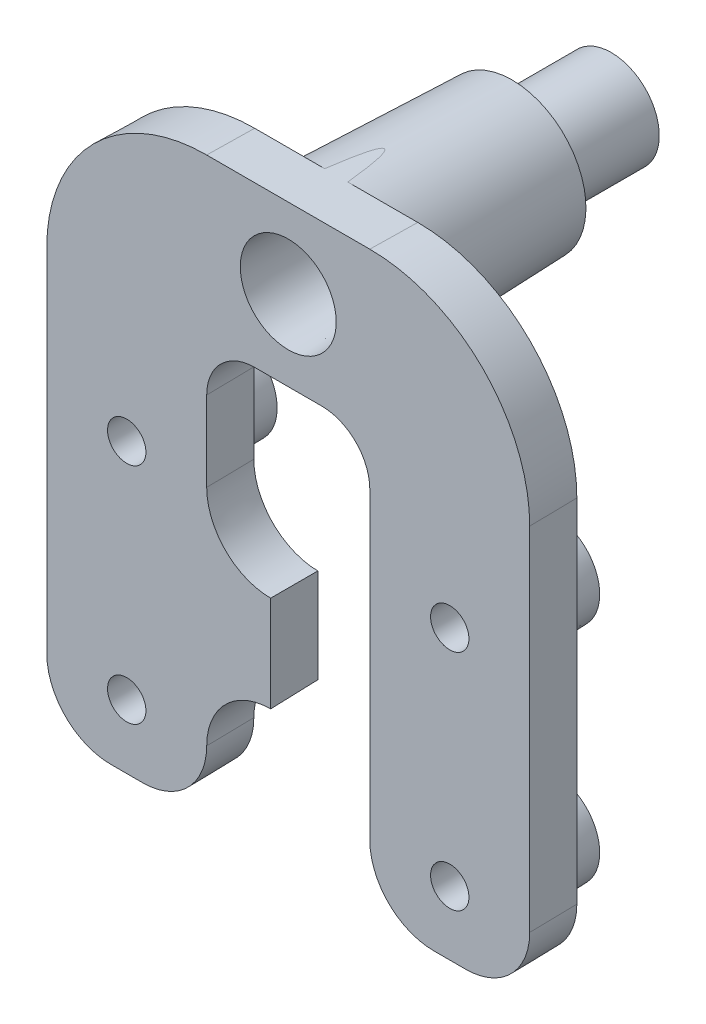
ISO-10303-21;
HEADER;
FILE_DESCRIPTION(('STEP AP214'),'2;1');
FILE_NAME('part.step','',(''),(''),'','','');
FILE_SCHEMA(('AUTOMOTIVE_DESIGN { 1 0 10303 214 1 1 1 1 }'));
ENDSEC;
DATA;
#1=APPLICATION_CONTEXT('core data for automotive mechanical design processes');
#2=APPLICATION_PROTOCOL_DEFINITION('international standard','automotive_design',2000,#1);
#3=PRODUCT_CONTEXT('',#1,'mechanical');
#4=PRODUCT('Part','Part','',(#3));
#5=PRODUCT_RELATED_PRODUCT_CATEGORY('part','',(#4));
#6=PRODUCT_DEFINITION_FORMATION('','',#4);
#7=PRODUCT_DEFINITION_CONTEXT('part definition',#1,'design');
#8=PRODUCT_DEFINITION('design','',#6,#7);
#9=PRODUCT_DEFINITION_SHAPE('','',#8);
#10=(LENGTH_UNIT() NAMED_UNIT(*) SI_UNIT(.MILLI.,.METRE.));
#11=(NAMED_UNIT(*) PLANE_ANGLE_UNIT() SI_UNIT($,.RADIAN.));
#12=(NAMED_UNIT(*) SI_UNIT($,.STERADIAN.) SOLID_ANGLE_UNIT());
#13=UNCERTAINTY_MEASURE_WITH_UNIT(LENGTH_MEASURE(1.E-05),#10,'distance_accuracy_value','');
#14=(GEOMETRIC_REPRESENTATION_CONTEXT(3) GLOBAL_UNCERTAINTY_ASSIGNED_CONTEXT((#13)) GLOBAL_UNIT_ASSIGNED_CONTEXT((#10,
#11,#12)) REPRESENTATION_CONTEXT('',''));
#15=CARTESIAN_POINT('',(0.,0.,0.));
#16=DIRECTION('',(0.,0.,1.));
#17=DIRECTION('',(1.,0.,0.));
#18=AXIS2_PLACEMENT_3D('',#15,#16,#17);
#19=CARTESIAN_POINT('',(5.12101812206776,-90.4545989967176,-3.01499999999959));
#20=DIRECTION('',(0.,0.,-1.));
#21=DIRECTION('',(0.,1.,0.));
#22=AXIS2_PLACEMENT_3D('',#19,#20,#21);
#23=PLANE('',#22);
#24=CARTESIAN_POINT('',(-10.1549818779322,-108.544598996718,-3.01499999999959));
#25=DIRECTION('',(0.,0.,-1.));
#26=DIRECTION('',(0.,1.,0.));
#27=AXIS2_PLACEMENT_3D('',#24,#25,#26);
#28=CIRCLE('',#27,3.04224300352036);
#29=CARTESIAN_POINT('',(-10.1549818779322,-105.502355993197,-3.01499999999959));
#30=VERTEX_POINT('',#29);
#31=EDGE_CURVE('E486',#30,#30,#28,.T.);
#32=ORIENTED_EDGE('',*,*,#31,.F.);
#33=EDGE_LOOP('',(#32));
#34=FACE_BOUND('',#33,.T.);
#35=DIRECTION('',(0.,1.,0.));
#36=VECTOR('',#35,1.);
#37=CARTESIAN_POINT('',(-15.1273548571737,-90.4545989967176,-3.01499999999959));
#38=LINE('',#37,#36);
#39=CARTESIAN_POINT('',(-15.1273548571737,-100.504598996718,-3.01499999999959));
#40=VERTEX_POINT('',#39);
#41=CARTESIAN_POINT('',(-15.1273548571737,-122.614598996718,-3.01499999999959));
#42=VERTEX_POINT('',#41);
#43=EDGE_CURVE('E622',#40,#42,#38,.F.);
#44=ORIENTED_EDGE('',*,*,#43,.F.);
#45=CARTESIAN_POINT('',(-5.12998187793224,-100.504598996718,-3.01499999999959));
#46=DIRECTION('',(0.,0.,-1.));
#47=DIRECTION('',(0.,-1.,0.));
#48=AXIS2_PLACEMENT_3D('',#45,#46,#47);
#49=CIRCLE('',#48,9.99737297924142);
#50=CARTESIAN_POINT('',(-5.12998187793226,-90.5072260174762,-3.01499999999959));
#51=VERTEX_POINT('',#50);
#52=EDGE_CURVE('E249',#40,#51,#49,.T.);
#53=ORIENTED_EDGE('',*,*,#52,.T.);
#54=DIRECTION('',(1.,0.,0.));
#55=VECTOR('',#54,1.);
#56=CARTESIAN_POINT('',(5.12101812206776,-90.5072260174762,-3.01499999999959));
#57=LINE('',#56,#55);
#58=CARTESIAN_POINT('',(-0.729831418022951,-90.5072260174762,-3.01499999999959));
#59=VERTEX_POINT('',#58);
#60=EDGE_CURVE('E628',#59,#51,#57,.F.);
#61=ORIENTED_EDGE('',*,*,#60,.F.);
#62=CARTESIAN_POINT('',(-0.00448187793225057,-95.4795989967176,-3.01499999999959));
#63=DIRECTION('',(0.,0.,-1.));
#64=DIRECTION('',(0.,1.,0.));
#65=AXIS2_PLACEMENT_3D('',#62,#63,#64);
#66=CIRCLE('',#65,5.025);
#67=CARTESIAN_POINT('',(-0.729831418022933,-100.451971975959,-3.01499999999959));
#68=VERTEX_POINT('',#67);
#69=EDGE_CURVE('E221',#68,#59,#66,.T.);
#70=ORIENTED_EDGE('',*,*,#69,.F.);
#71=DIRECTION('',(-1.,0.,0.));
#72=VECTOR('',#71,1.);
#73=CARTESIAN_POINT('',(5.12101812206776,-100.451971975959,-3.01499999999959));
#74=LINE('',#73,#72);
#75=CARTESIAN_POINT('',(-2.11498187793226,-100.451971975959,-3.01499999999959));
#76=VERTEX_POINT('',#75);
#77=EDGE_CURVE('E608',#76,#68,#74,.F.);
#78=ORIENTED_EDGE('',*,*,#77,.F.);
#79=CARTESIAN_POINT('',(-2.11498187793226,-103.519598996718,-3.01499999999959));
#80=DIRECTION('',(0.,0.,-1.));
#81=DIRECTION('',(0.,-1.,0.));
#82=AXIS2_PLACEMENT_3D('',#79,#80,#81);
#83=CIRCLE('',#82,3.06762702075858);
#84=CARTESIAN_POINT('',(-5.18260889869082,-103.519598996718,-3.01499999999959));
#85=VERTEX_POINT('',#84);
#86=EDGE_CURVE('E550',#76,#85,#83,.F.);
#87=ORIENTED_EDGE('',*,*,#86,.T.);
#88=DIRECTION('',(0.,-1.,0.));
#89=VECTOR('',#88,1.);
#90=CARTESIAN_POINT('',(-5.18260889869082,-90.4545989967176,-3.01499999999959));
#91=LINE('',#90,#89);
#92=CARTESIAN_POINT('',(-5.18260889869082,-108.544598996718,-3.01499999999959));
#93=VERTEX_POINT('',#92);
#94=EDGE_CURVE('E655',#93,#85,#91,.F.);
#95=ORIENTED_EDGE('',*,*,#94,.F.);
#96=CARTESIAN_POINT('',(-1.10998187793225,-108.544598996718,-3.01499999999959));
#97=DIRECTION('',(0.,0.,-1.));
#98=DIRECTION('',(0.,-1.,0.));
#99=AXIS2_PLACEMENT_3D('',#96,#97,#98);
#100=CIRCLE('',#99,4.07262702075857);
#101=CARTESIAN_POINT('',(-1.16260889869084,-112.616885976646,-3.01499999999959));
#102=VERTEX_POINT('',#101);
#103=EDGE_CURVE('E545',#93,#102,#100,.F.);
#104=ORIENTED_EDGE('',*,*,#103,.T.);
#105=DIRECTION('',(0.,-1.,0.));
#106=VECTOR('',#105,1.);
#107=CARTESIAN_POINT('',(-1.16260889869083,-90.4545989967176,-3.01499999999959));
#108=LINE('',#107,#106);
#109=CARTESIAN_POINT('',(-1.16260889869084,-118.542312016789,-3.01499999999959));
#110=VERTEX_POINT('',#109);
#111=EDGE_CURVE('E663',#110,#102,#108,.F.);
#112=ORIENTED_EDGE('',*,*,#111,.F.);
#113=CARTESIAN_POINT('',(-1.10998187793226,-122.614598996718,-3.01499999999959));
#114=DIRECTION('',(0.,0.,-1.));
#115=DIRECTION('',(0.,-1.,0.));
#116=AXIS2_PLACEMENT_3D('',#113,#114,#115);
#117=CIRCLE('',#116,4.07262702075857);
#118=CARTESIAN_POINT('',(-5.18260889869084,-122.614598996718,-3.01499999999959));
#119=VERTEX_POINT('',#118);
#120=EDGE_CURVE('E242',#110,#119,#117,.F.);
#121=ORIENTED_EDGE('',*,*,#120,.T.);
#122=CARTESIAN_POINT('',(-9.14998187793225,-122.614598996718,-3.01499999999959));
#123=DIRECTION('',(0.,0.,-1.));
#124=DIRECTION('',(0.,-1.,0.));
#125=AXIS2_PLACEMENT_3D('',#122,#123,#124);
#126=CIRCLE('',#125,3.96737297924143);
#127=CARTESIAN_POINT('',(-9.14998187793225,-126.581971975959,-3.01499999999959));
#128=VERTEX_POINT('',#127);
#129=EDGE_CURVE('E193',#119,#128,#126,.T.);
#130=ORIENTED_EDGE('',*,*,#129,.T.);
#131=DIRECTION('',(-1.,0.,0.));
#132=VECTOR('',#131,1.);
#133=CARTESIAN_POINT('',(5.12101812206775,-126.581971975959,-3.01499999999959));
#134=LINE('',#133,#132);
#135=CARTESIAN_POINT('',(-11.1599818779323,-126.581971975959,-3.01499999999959));
#136=VERTEX_POINT('',#135);
#137=EDGE_CURVE('E210',#136,#128,#134,.F.);
#138=ORIENTED_EDGE('',*,*,#137,.F.);
#139=CARTESIAN_POINT('',(-11.1599818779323,-122.614598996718,-3.01499999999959));
#140=DIRECTION('',(0.,0.,-1.));
#141=DIRECTION('',(0.,-1.,0.));
#142=AXIS2_PLACEMENT_3D('',#139,#140,#141);
#143=CIRCLE('',#142,3.96737297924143);
#144=EDGE_CURVE('E191',#136,#42,#143,.T.);
#145=ORIENTED_EDGE('',*,*,#144,.T.);
#146=EDGE_LOOP('',(#44,#53,#61,#70,#78,#87,#95,#104,#112,#121,#130,#138,#145));
#147=FACE_BOUND('',#146,.T.);
#148=CARTESIAN_POINT('',(-10.1549818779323,-122.614598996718,-3.01499999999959));
#149=DIRECTION('',(0.,0.,-1.));
#150=DIRECTION('',(0.,1.,0.));
#151=AXIS2_PLACEMENT_3D('',#148,#149,#150);
#152=CIRCLE('',#151,3.015);
#153=CARTESIAN_POINT('',(-10.1549818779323,-119.599598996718,-3.01499999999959));
#154=VERTEX_POINT('',#153);
#155=EDGE_CURVE('E481',#154,#154,#152,.T.);
#156=ORIENTED_EDGE('',*,*,#155,.F.);
#157=EDGE_LOOP('',(#156));
#158=FACE_BOUND('',#157,.T.);
#159=ADVANCED_FACE('F16',(#34,#147,#158),#23,.T.);
#160=CARTESIAN_POINT('',(10.1460181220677,-108.544598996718,-3.01499999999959));
#161=DIRECTION('',(0.,0.,-1.));
#162=DIRECTION('',(0.,1.,0.));
#163=AXIS2_PLACEMENT_3D('',#160,#161,#162);
#164=CIRCLE('',#163,3.015);
#165=CARTESIAN_POINT('',(10.1460181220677,-105.529598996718,-3.01499999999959));
#166=VERTEX_POINT('',#165);
#167=EDGE_CURVE('E496',#166,#166,#164,.T.);
#168=ORIENTED_EDGE('',*,*,#167,.F.);
#169=EDGE_LOOP('',(#168));
#170=FACE_BOUND('',#169,.T.);
#171=DIRECTION('',(1.,0.,0.));
#172=VECTOR('',#171,1.);
#173=CARTESIAN_POINT('',(5.12101812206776,-90.5072260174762,-3.01499999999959));
#174=LINE('',#173,#172);
#175=CARTESIAN_POINT('',(5.12101812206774,-90.5072260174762,-3.01499999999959));
#176=VERTEX_POINT('',#175);
#177=CARTESIAN_POINT('',(0.720867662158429,-90.5072260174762,-3.01499999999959));
#178=VERTEX_POINT('',#177);
#179=EDGE_CURVE('E625',#176,#178,#174,.F.);
#180=ORIENTED_EDGE('',*,*,#179,.F.);
#181=CARTESIAN_POINT('',(5.12101812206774,-100.504598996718,-3.01499999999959));
#182=DIRECTION('',(0.,0.,-1.));
#183=DIRECTION('',(0.,-1.,0.));
#184=AXIS2_PLACEMENT_3D('',#181,#182,#183);
#185=CIRCLE('',#184,9.99737297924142);
#186=CARTESIAN_POINT('',(15.1183911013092,-100.504598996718,-3.01499999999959));
#187=VERTEX_POINT('',#186);
#188=EDGE_CURVE('E564',#176,#187,#185,.T.);
#189=ORIENTED_EDGE('',*,*,#188,.T.);
#190=DIRECTION('',(0.,-1.,0.));
#191=VECTOR('',#190,1.);
#192=CARTESIAN_POINT('',(15.1183911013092,-90.4545989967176,-3.01499999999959));
#193=LINE('',#192,#191);
#194=CARTESIAN_POINT('',(15.1183911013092,-122.614598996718,-3.01499999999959));
#195=VERTEX_POINT('',#194);
#196=EDGE_CURVE('E631',#195,#187,#193,.F.);
#197=ORIENTED_EDGE('',*,*,#196,.F.);
#198=CARTESIAN_POINT('',(11.1510181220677,-122.614598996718,-3.01499999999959));
#199=DIRECTION('',(0.,0.,-1.));
#200=DIRECTION('',(0.,-1.,0.));
#201=AXIS2_PLACEMENT_3D('',#198,#199,#200);
#202=CIRCLE('',#201,3.96737297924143);
#203=CARTESIAN_POINT('',(11.1510181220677,-126.581971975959,-3.01499999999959));
#204=VERTEX_POINT('',#203);
#205=EDGE_CURVE('E236',#195,#204,#202,.T.);
#206=ORIENTED_EDGE('',*,*,#205,.T.);
#207=DIRECTION('',(-1.,0.,0.));
#208=VECTOR('',#207,1.);
#209=CARTESIAN_POINT('',(5.12101812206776,-126.581971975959,-3.01499999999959));
#210=LINE('',#209,#208);
#211=CARTESIAN_POINT('',(9.14101812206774,-126.581971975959,-3.01499999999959));
#212=VERTEX_POINT('',#211);
#213=EDGE_CURVE('E639',#212,#204,#210,.F.);
#214=ORIENTED_EDGE('',*,*,#213,.F.);
#215=CARTESIAN_POINT('',(9.14101812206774,-122.614598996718,-3.01499999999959));
#216=DIRECTION('',(0.,0.,-1.));
#217=DIRECTION('',(0.,-1.,0.));
#218=AXIS2_PLACEMENT_3D('',#215,#216,#217);
#219=CIRCLE('',#218,3.96737297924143);
#220=CARTESIAN_POINT('',(5.17364514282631,-122.614598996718,-3.01499999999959));
#221=VERTEX_POINT('',#220);
#222=EDGE_CURVE('E642',#212,#221,#219,.T.);
#223=ORIENTED_EDGE('',*,*,#222,.T.);
#224=DIRECTION('',(0.,1.,0.));
#225=VECTOR('',#224,1.);
#226=CARTESIAN_POINT('',(5.17364514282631,-90.4545989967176,-3.01499999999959));
#227=LINE('',#226,#225);
#228=CARTESIAN_POINT('',(5.17364514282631,-103.519598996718,-3.01499999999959));
#229=VERTEX_POINT('',#228);
#230=EDGE_CURVE('E525',#229,#221,#227,.F.);
#231=ORIENTED_EDGE('',*,*,#230,.F.);
#232=CARTESIAN_POINT('',(2.10601812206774,-103.519598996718,-3.01499999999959));
#233=DIRECTION('',(0.,0.,-1.));
#234=DIRECTION('',(0.,-1.,0.));
#235=AXIS2_PLACEMENT_3D('',#232,#233,#234);
#236=CIRCLE('',#235,3.06762702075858);
#237=CARTESIAN_POINT('',(2.10601812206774,-100.451971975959,-3.01499999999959));
#238=VERTEX_POINT('',#237);
#239=EDGE_CURVE('E554',#229,#238,#236,.F.);
#240=ORIENTED_EDGE('',*,*,#239,.T.);
#241=DIRECTION('',(-1.,0.,0.));
#242=VECTOR('',#241,1.);
#243=CARTESIAN_POINT('',(5.12101812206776,-100.451971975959,-3.01499999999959));
#244=LINE('',#243,#242);
#245=CARTESIAN_POINT('',(0.720867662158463,-100.451971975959,-3.01499999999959));
#246=VERTEX_POINT('',#245);
#247=EDGE_CURVE('E652',#246,#238,#244,.F.);
#248=ORIENTED_EDGE('',*,*,#247,.F.);
#249=CARTESIAN_POINT('',(-0.00448187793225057,-95.4795989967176,-3.01499999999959));
#250=DIRECTION('',(0.,0.,-1.));
#251=DIRECTION('',(0.,1.,0.));
#252=AXIS2_PLACEMENT_3D('',#249,#250,#251);
#253=CIRCLE('',#252,5.025);
#254=EDGE_CURVE('E517',#178,#246,#253,.T.);
#255=ORIENTED_EDGE('',*,*,#254,.F.);
#256=EDGE_LOOP('',(#180,#189,#197,#206,#214,#223,#231,#240,#248,#255));
#257=FACE_BOUND('',#256,.T.);
#258=CARTESIAN_POINT('',(10.1460181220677,-122.614598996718,-3.01499999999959));
#259=DIRECTION('',(0.,0.,-1.));
#260=DIRECTION('',(0.,1.,0.));
#261=AXIS2_PLACEMENT_3D('',#258,#259,#260);
#262=CIRCLE('',#261,3.015);
#263=CARTESIAN_POINT('',(10.1460181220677,-119.599598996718,-3.01499999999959));
#264=VERTEX_POINT('',#263);
#265=EDGE_CURVE('E491',#264,#264,#262,.T.);
#266=ORIENTED_EDGE('',*,*,#265,.F.);
#267=EDGE_LOOP('',(#266));
#268=FACE_BOUND('',#267,.T.);
#269=ADVANCED_FACE('F388',(#170,#257,#268),#23,.T.);
#270=CARTESIAN_POINT('',(-0.00448187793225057,-95.4795989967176,4.11441714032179E-13));
#271=DIRECTION('',(0.,0.,-1.));
#272=DIRECTION('',(0.,1.,0.));
#273=AXIS2_PLACEMENT_3D('',#270,#271,#272);
#274=CYLINDRICAL_SURFACE('',#273,1.206);
#275=CARTESIAN_POINT('',(-0.00448187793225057,-95.4795989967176,-20.3009999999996));
#276=DIRECTION('',(0.,0.,-1.));
#277=DIRECTION('',(0.,1.,0.));
#278=AXIS2_PLACEMENT_3D('',#275,#276,#277);
#279=CIRCLE('',#278,1.206);
#280=CARTESIAN_POINT('',(-0.00448187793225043,-94.2735989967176,-20.3009999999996));
#281=VERTEX_POINT('',#280);
#282=EDGE_CURVE('E504',#281,#281,#279,.T.);
#283=ORIENTED_EDGE('',*,*,#282,.T.);
#284=EDGE_LOOP('',(#283));
#285=FACE_BOUND('',#284,.T.);
#286=CARTESIAN_POINT('',(-0.00448187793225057,-95.4795989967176,-11.5574999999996));
#287=DIRECTION('',(0.,0.,1.));
#288=DIRECTION('',(0.,-1.,0.));
#289=AXIS2_PLACEMENT_3D('',#286,#287,#288);
#290=CIRCLE('',#289,1.206);
#291=CARTESIAN_POINT('',(-0.00448187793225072,-96.6855989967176,-11.5574999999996));
#292=VERTEX_POINT('',#291);
#293=EDGE_CURVE('E509',#292,#292,#290,.F.);
#294=ORIENTED_EDGE('',*,*,#293,.F.);
#295=EDGE_LOOP('',(#294));
#296=FACE_BOUND('',#295,.T.);
#297=ADVANCED_FACE('F392',(#285,#296),#274,.F.);
#298=CARTESIAN_POINT('',(-0.00448187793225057,-95.4795989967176,-14.0699999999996));
#299=DIRECTION('',(0.,0.,-1.));
#300=DIRECTION('',(0.,1.,0.));
#301=AXIS2_PLACEMENT_3D('',#298,#299,#300);
#302=PLANE('',#301);
#303=CARTESIAN_POINT('',(-0.00448187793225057,-95.4795989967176,-14.0699999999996));
#304=DIRECTION('',(0.,0.,-1.));
#305=DIRECTION('',(0.,1.,0.));
#306=AXIS2_PLACEMENT_3D('',#303,#304,#305);
#307=CIRCLE('',#306,4.63895089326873);
#308=CARTESIAN_POINT('',(-0.00448187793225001,-90.8406481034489,-14.0699999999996));
#309=VERTEX_POINT('',#308);
#310=EDGE_CURVE('E521',#309,#309,#307,.T.);
#311=ORIENTED_EDGE('',*,*,#310,.T.);
#312=EDGE_LOOP('',(#311));
#313=FACE_BOUND('',#312,.T.);
#314=CARTESIAN_POINT('',(-0.00448187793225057,-95.4795989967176,-14.0699999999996));
#315=DIRECTION('',(0.,0.,-1.));
#316=DIRECTION('',(0.,1.,0.));
#317=AXIS2_PLACEMENT_3D('',#314,#315,#316);
#318=CIRCLE('',#317,3.015);
#319=CARTESIAN_POINT('',(-0.00448187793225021,-92.4645989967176,-14.0699999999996));
#320=VERTEX_POINT('',#319);
#321=EDGE_CURVE('E508',#320,#320,#318,.T.);
#322=ORIENTED_EDGE('',*,*,#321,.F.);
#323=EDGE_LOOP('',(#322));
#324=FACE_BOUND('',#323,.T.);
#325=ADVANCED_FACE('F300',(#313,#324),#302,.T.);
#326=CARTESIAN_POINT('',(5.12101812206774,-90.4545989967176,4.11441714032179E-13));
#327=DIRECTION('',(-0.999847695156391,0.,-0.0174524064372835));
#328=DIRECTION('',(-0.0174524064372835,0.,0.999847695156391));
#329=AXIS2_PLACEMENT_3D('',#326,#327,#328);
#330=PLANE('',#329);
#331=DIRECTION('',(0.,1.,0.));
#332=VECTOR('',#331,1.);
#333=CARTESIAN_POINT('',(5.12101812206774,-90.4545989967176,4.11441714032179E-13));
#334=LINE('',#333,#332);
#335=CARTESIAN_POINT('',(5.12101812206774,-103.519598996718,4.11441714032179E-13));
#336=VERTEX_POINT('',#335);
#337=CARTESIAN_POINT('',(5.12101812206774,-122.614598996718,4.11441714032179E-13));
#338=VERTEX_POINT('',#337);
#339=EDGE_CURVE('E604',#336,#338,#334,.F.);
#340=ORIENTED_EDGE('',*,*,#339,.F.);
#341=DIRECTION('',(-0.0174524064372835,0.,0.999847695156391));
#342=VECTOR('',#341,1.);
#343=CARTESIAN_POINT('',(5.12101812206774,-103.519598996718,4.11401093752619E-13));
#344=LINE('',#343,#342);
#345=EDGE_CURVE('E227',#336,#229,#344,.F.);
#346=ORIENTED_EDGE('',*,*,#345,.T.);
#347=ORIENTED_EDGE('',*,*,#230,.T.);
#348=DIRECTION('',(-0.0174524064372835,0.,0.999847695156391));
#349=VECTOR('',#348,1.);
#350=CARTESIAN_POINT('',(5.12101812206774,-122.614598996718,4.11098425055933E-13));
#351=LINE('',#350,#349);
#352=EDGE_CURVE('E243',#221,#338,#351,.T.);
#353=ORIENTED_EDGE('',*,*,#352,.T.);
#354=EDGE_LOOP('',(#340,#346,#347,#353));
#355=FACE_BOUND('',#354,.T.);
#356=ADVANCED_FACE('F293',(#355),#330,.T.);
#357=CARTESIAN_POINT('',(5.12101812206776,-126.634598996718,4.11441714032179E-13));
#358=DIRECTION('',(0.,-0.999847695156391,-0.0174524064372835));
#359=DIRECTION('',(0.,-0.0174524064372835,0.999847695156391));
#360=AXIS2_PLACEMENT_3D('',#357,#358,#359);
#361=PLANE('',#360);
#362=DIRECTION('',(-1.,0.,0.));
#363=VECTOR('',#362,1.);
#364=CARTESIAN_POINT('',(5.12101812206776,-126.634598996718,4.11441714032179E-13));
#365=LINE('',#364,#363);
#366=CARTESIAN_POINT('',(9.14101812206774,-126.634598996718,4.11441714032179E-13));
#367=VERTEX_POINT('',#366);
#368=CARTESIAN_POINT('',(11.1510181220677,-126.634598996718,4.11441714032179E-13));
#369=VERTEX_POINT('',#368);
#370=EDGE_CURVE('E607',#367,#369,#365,.F.);
#371=ORIENTED_EDGE('',*,*,#370,.F.);
#372=DIRECTION('',(0.,-0.0174524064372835,0.999847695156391));
#373=VECTOR('',#372,1.);
#374=CARTESIAN_POINT('',(9.14101812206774,-126.634598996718,4.11448869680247E-13));
#375=LINE('',#374,#373);
#376=EDGE_CURVE('E232',#367,#212,#375,.F.);
#377=ORIENTED_EDGE('',*,*,#376,.T.);
#378=ORIENTED_EDGE('',*,*,#213,.T.);
#379=DIRECTION('',(0.,-0.0174524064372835,0.999847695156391));
#380=VECTOR('',#379,1.);
#381=CARTESIAN_POINT('',(11.1510181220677,-126.634598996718,4.11452447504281E-13));
#382=LINE('',#381,#380);
#383=EDGE_CURVE('E237',#204,#369,#382,.T.);
#384=ORIENTED_EDGE('',*,*,#383,.T.);
#385=EDGE_LOOP('',(#371,#377,#378,#384));
#386=FACE_BOUND('',#385,.T.);
#387=ADVANCED_FACE('F285',(#386),#361,.T.);
#388=CARTESIAN_POINT('',(15.1710181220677,-90.4545989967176,4.11441714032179E-13));
#389=DIRECTION('',(0.999847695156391,0.,-0.0174524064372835));
#390=DIRECTION('',(-0.0174524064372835,0.,-0.999847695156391));
#391=AXIS2_PLACEMENT_3D('',#388,#389,#390);
#392=PLANE('',#391);
#393=ORIENTED_EDGE('',*,*,#196,.T.);
#394=DIRECTION('',(0.0174524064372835,0.,0.999847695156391));
#395=VECTOR('',#394,1.);
#396=CARTESIAN_POINT('',(15.1710181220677,-100.504598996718,4.11484659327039E-13));
#397=LINE('',#396,#395);
#398=CARTESIAN_POINT('',(15.1710181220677,-100.504598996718,4.11441714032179E-13));
#399=VERTEX_POINT('',#398);
#400=EDGE_CURVE('E231',#187,#399,#397,.T.);
#401=ORIENTED_EDGE('',*,*,#400,.T.);
#402=DIRECTION('',(0.,-1.,0.));
#403=VECTOR('',#402,1.);
#404=CARTESIAN_POINT('',(15.1710181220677,-90.4545989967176,4.11441714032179E-13));
#405=LINE('',#404,#403);
#406=CARTESIAN_POINT('',(15.1710181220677,-122.614598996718,4.11441714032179E-13));
#407=VERTEX_POINT('',#406);
#408=EDGE_CURVE('E611',#407,#399,#405,.F.);
#409=ORIENTED_EDGE('',*,*,#408,.F.);
#410=DIRECTION('',(0.0174524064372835,0.,0.999847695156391));
#411=VECTOR('',#410,1.);
#412=CARTESIAN_POINT('',(15.1710181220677,-122.614598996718,4.11335801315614E-13));
#413=LINE('',#412,#411);
#414=EDGE_CURVE('E238',#407,#195,#413,.F.);
#415=ORIENTED_EDGE('',*,*,#414,.T.);
#416=EDGE_LOOP('',(#393,#401,#409,#415));
#417=FACE_BOUND('',#416,.T.);
#418=ADVANCED_FACE('F278',(#417),#392,.T.);
#419=CARTESIAN_POINT('',(5.12101812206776,-90.4545989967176,4.11441714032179E-13));
#420=DIRECTION('',(0.,0.999847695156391,-0.0174524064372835));
#421=DIRECTION('',(0.,-0.0174524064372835,-0.999847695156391));
#422=AXIS2_PLACEMENT_3D('',#419,#420,#421);
#423=PLANE('',#422);
#424=ORIENTED_EDGE('',*,*,#60,.T.);
#425=DIRECTION('',(0.,0.0174524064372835,0.999847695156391));
#426=VECTOR('',#425,1.);
#427=CARTESIAN_POINT('',(-5.12998187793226,-90.4545989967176,4.11397909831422E-13));
#428=LINE('',#427,#426);
#429=CARTESIAN_POINT('',(-5.12998187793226,-90.4545989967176,4.11441714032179E-13));
#430=VERTEX_POINT('',#429);
#431=EDGE_CURVE('E248',#51,#430,#428,.T.);
#432=ORIENTED_EDGE('',*,*,#431,.T.);
#433=DIRECTION('',(1.,0.,0.));
#434=VECTOR('',#433,1.);
#435=CARTESIAN_POINT('',(5.12101812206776,-90.4545989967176,4.11441714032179E-13));
#436=LINE('',#435,#434);
#437=CARTESIAN_POINT('',(5.12101812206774,-90.4545989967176,4.11441714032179E-13));
#438=VERTEX_POINT('',#437);
#439=EDGE_CURVE('E615',#438,#430,#436,.F.);
#440=ORIENTED_EDGE('',*,*,#439,.F.);
#441=DIRECTION('',(0.,0.0174524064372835,0.999847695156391));
#442=VECTOR('',#441,1.);
#443=CARTESIAN_POINT('',(5.12101812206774,-90.4545989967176,4.11441714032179E-13));
#444=LINE('',#443,#442);
#445=EDGE_CURVE('E244',#438,#176,#444,.F.);
#446=ORIENTED_EDGE('',*,*,#445,.T.);
#447=ORIENTED_EDGE('',*,*,#179,.T.);
#448=CARTESIAN_POINT('',(-0.729831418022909,-90.5072260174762,-3.01499999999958));
#449=CARTESIAN_POINT('',(-0.705760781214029,-90.5106489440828,-3.21109933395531));
#450=CARTESIAN_POINT('',(-0.68077111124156,-90.5140700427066,-3.40709394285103));
#451=CARTESIAN_POINT('',(-0.627606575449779,-90.520916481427,-3.79932615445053));
#452=CARTESIAN_POINT('',(-0.59942116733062,-90.5243417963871,-3.99556231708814));
#453=CARTESIAN_POINT('',(-0.537251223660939,-90.5313403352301,-4.3965083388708));
#454=CARTESIAN_POINT('',(-0.50305789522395,-90.5349130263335,-4.60118767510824));
#455=CARTESIAN_POINT('',(-0.445172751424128,-90.5402475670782,-4.90680330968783));
#456=CARTESIAN_POINT('',(-0.424795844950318,-90.5420203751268,-5.00836741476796));
#457=CARTESIAN_POINT('',(-0.38075206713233,-90.5455533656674,-5.21077230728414));
#458=CARTESIAN_POINT('',(-0.357086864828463,-90.5473135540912,-5.31161343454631));
#459=CARTESIAN_POINT('',(-0.312032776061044,-90.5502743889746,-5.48123955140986));
#460=CARTESIAN_POINT('',(-0.292146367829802,-90.5514821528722,-5.55043229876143));
#461=CARTESIAN_POINT('',(-0.247842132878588,-90.5538703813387,-5.68725381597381));
#462=CARTESIAN_POINT('',(-0.223442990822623,-90.5550509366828,-5.7548877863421));
#463=CARTESIAN_POINT('',(-0.182818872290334,-90.5566046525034,-5.84390010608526));
#464=CARTESIAN_POINT('',(-0.171248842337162,-90.5570142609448,-5.86736655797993));
#465=CARTESIAN_POINT('',(-0.145741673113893,-90.5578127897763,-5.91311424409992));
#466=CARTESIAN_POINT('',(-0.13180295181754,-90.5582016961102,-5.93539467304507));
#467=CARTESIAN_POINT('',(-0.107686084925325,-90.5587459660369,-5.96657587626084));
#468=CARTESIAN_POINT('',(-0.0990513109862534,-90.5589217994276,-5.97664936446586));
#469=CARTESIAN_POINT('',(-0.0802718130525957,-90.5592466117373,-5.99525784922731));
#470=CARTESIAN_POINT('',(-0.0701396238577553,-90.5593957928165,-6.00380442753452));
#471=CARTESIAN_POINT('',(-0.0543540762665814,-90.5595705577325,-6.01381670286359));
#472=CARTESIAN_POINT('',(-0.0494974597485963,-90.5596177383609,-6.01651967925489));
#473=CARTESIAN_POINT('',(-0.0394409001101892,-90.5596994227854,-6.02119937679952));
#474=CARTESIAN_POINT('',(-0.034241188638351,-90.5597339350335,-6.02317658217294));
#475=CARTESIAN_POINT('',(-0.0235105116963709,-90.559787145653,-6.02622501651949));
#476=CARTESIAN_POINT('',(-0.0179764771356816,-90.559805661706,-6.02728580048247));
#477=CARTESIAN_POINT('',(-0.00680812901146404,-90.5598235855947,-6.02831265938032));
#478=CARTESIAN_POINT('',(-0.00117390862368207,-90.5598230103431,-6.02827970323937));
#479=CARTESIAN_POINT('',(0.00934561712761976,-90.5598040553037,-6.02719376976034));
#480=CARTESIAN_POINT('',(0.0142435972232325,-90.5597876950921,-6.02625649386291));
#481=CARTESIAN_POINT('',(0.0238330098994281,-90.5597418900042,-6.02363232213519));
#482=CARTESIAN_POINT('',(0.0285242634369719,-90.5597124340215,-6.021944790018));
#483=CARTESIAN_POINT('',(0.0400779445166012,-90.5596243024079,-6.01689573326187));
#484=CARTESIAN_POINT('',(0.0467582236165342,-90.5595584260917,-6.01312168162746));
#485=CARTESIAN_POINT('',(0.0594672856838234,-90.5594097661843,-6.0046049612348));
#486=CARTESIAN_POINT('',(0.0654940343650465,-90.5593269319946,-5.9998593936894));
#487=CARTESIAN_POINT('',(0.0851095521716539,-90.5590257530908,-5.98260486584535));
#488=CARTESIAN_POINT('',(0.0973534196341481,-90.5587812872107,-5.96859942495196));
#489=CARTESIAN_POINT('',(0.119795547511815,-90.5582652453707,-5.93903540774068));
#490=CARTESIAN_POINT('',(0.129979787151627,-90.5579935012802,-5.92346719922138));
#491=CARTESIAN_POINT('',(0.174607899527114,-90.5566960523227,-5.84913639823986));
#492=CARTESIAN_POINT('',(0.201308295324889,-90.5555925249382,-5.78591535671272));
#493=CARTESIAN_POINT('',(0.249029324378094,-90.5533534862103,-5.65764091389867));
#494=CARTESIAN_POINT('',(0.270027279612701,-90.552217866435,-5.59258130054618));
#495=CARTESIAN_POINT('',(0.32762430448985,-90.5488116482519,-5.39743919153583));
#496=CARTESIAN_POINT('',(0.359446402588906,-90.5465151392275,-5.26587227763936));
#497=CARTESIAN_POINT('',(0.41759332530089,-90.5419008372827,-5.00151909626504));
#498=CARTESIAN_POINT('',(0.443909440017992,-90.5395830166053,-4.86873123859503));
#499=CARTESIAN_POINT('',(0.49294245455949,-90.5349393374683,-4.60269503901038));
#500=CARTESIAN_POINT('',(0.515665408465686,-90.5326134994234,-4.46944786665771));
#501=CARTESIAN_POINT('',(0.558725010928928,-90.5279571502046,-4.20268579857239));
#502=CARTESIAN_POINT('',(0.57906339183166,-90.5256266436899,-4.06917116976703));
#503=CARTESIAN_POINT('',(0.637536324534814,-90.5186232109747,-3.66794477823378));
#504=CARTESIAN_POINT('',(0.673076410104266,-90.5139436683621,-3.39985396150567));
#505=CARTESIAN_POINT('',(0.739904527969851,-90.5045752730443,-2.86313895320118));
#506=CARTESIAN_POINT('',(0.771192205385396,-90.4998864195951,-2.59451471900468));
#507=CARTESIAN_POINT('',(0.860690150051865,-90.4858054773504,-1.78781807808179));
#508=CARTESIAN_POINT('',(0.914490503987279,-90.4764048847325,-1.24925848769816));
#509=CARTESIAN_POINT('',(1.01493613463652,-90.4576726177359,-0.176087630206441));
#510=CARTESIAN_POINT('',(1.06163802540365,-90.4483410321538,0.358518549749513));
#511=CARTESIAN_POINT('',(1.12825338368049,-90.4343438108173,1.16041882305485));
#512=CARTESIAN_POINT('',(1.14987473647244,-90.4296806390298,1.42757175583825));
#513=CARTESIAN_POINT('',(1.19214607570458,-90.4203530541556,1.9619487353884));
#514=CARTESIAN_POINT('',(1.21279608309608,-90.4156886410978,2.22917278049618));
#515=CARTESIAN_POINT('',(1.23304284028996,-90.4110237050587,2.49642678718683));
#516=B_SPLINE_CURVE_WITH_KNOTS('',3,(#448,#449,#450,#451,#452,#453,#454,#455,#456,#457,#458,
#459,#460,#461,#462,#463,#464,#465,#466,#467,#468,#469,#470,#471,#472,#473,#474,#475,#476,#477,
#478,#479,#480,#481,#482,#483,#484,#485,#486,#487,#488,#489,#490,#491,#492,#493,#494,#495,#496,
#497,#498,#499,#500,#501,#502,#503,#504,#505,#506,#507,#508,#509,#510,#511,#512,#513,#514,#515),
.UNSPECIFIED.,.F.,.F.,(4,2,2,2,2,2,2,2,2,2,2,2,2,2,2,2,2,2,2,2,2,2,2,2,2,2,2,2,2,2,2,2,2,4),(0.,
0.59280674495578,1.18762933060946,1.81012564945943,2.12091886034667,2.43155489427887,
2.6475671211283,2.86270421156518,2.94116139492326,3.01967118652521,3.05940069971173,
3.09881472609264,3.11544470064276,3.1320635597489,3.14886942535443,3.16566040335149,
3.18055370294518,3.19545965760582,3.21834538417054,3.24130041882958,3.29668416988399,
3.35243311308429,3.55687292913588,3.76211425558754,4.16768333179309,4.57388920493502,
4.97940320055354,5.38462074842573,6.19597943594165,7.00740579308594,8.6312775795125,
10.2414289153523,11.0456281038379,11.8498099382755),.UNSPECIFIED.);
#517=EDGE_CURVE('E11',#59,#178,#516,.T.);
#518=ORIENTED_EDGE('',*,*,#517,.F.);
#519=EDGE_LOOP('',(#424,#432,#440,#446,#447,#518));
#520=FACE_BOUND('',#519,.T.);
#521=ADVANCED_FACE('F268',(#520),#423,.T.);
#522=CARTESIAN_POINT('',(-15.1799818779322,-90.4545989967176,4.11441714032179E-13));
#523=DIRECTION('',(-0.999847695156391,0.,-0.0174524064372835));
#524=DIRECTION('',(-0.0174524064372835,0.,0.999847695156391));
#525=AXIS2_PLACEMENT_3D('',#522,#523,#524);
#526=PLANE('',#525);
#527=DIRECTION('',(0.,1.,0.));
#528=VECTOR('',#527,1.);
#529=CARTESIAN_POINT('',(-15.1799818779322,-90.4545989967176,4.11441714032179E-13));
#530=LINE('',#529,#528);
#531=CARTESIAN_POINT('',(-15.1799818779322,-100.504598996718,4.11441714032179E-13));
#532=VERTEX_POINT('',#531);
#533=CARTESIAN_POINT('',(-15.1799818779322,-122.614598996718,4.11441714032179E-13));
#534=VERTEX_POINT('',#533);
#535=EDGE_CURVE('E169',#532,#534,#530,.F.);
#536=ORIENTED_EDGE('',*,*,#535,.F.);
#537=DIRECTION('',(-0.0174524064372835,0.,0.999847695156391));
#538=VECTOR('',#537,1.);
#539=CARTESIAN_POINT('',(-15.1799818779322,-100.504598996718,4.11385254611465E-13));
#540=LINE('',#539,#538);
#541=EDGE_CURVE('E250',#532,#40,#540,.F.);
#542=ORIENTED_EDGE('',*,*,#541,.T.);
#543=ORIENTED_EDGE('',*,*,#43,.T.);
#544=DIRECTION('',(-0.0174524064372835,0.,0.999847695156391));
#545=VECTOR('',#544,1.);
#546=CARTESIAN_POINT('',(-15.1799818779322,-122.614598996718,4.11480023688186E-13));
#547=LINE('',#546,#545);
#548=EDGE_CURVE('E541',#42,#534,#547,.T.);
#549=ORIENTED_EDGE('',*,*,#548,.T.);
#550=EDGE_LOOP('',(#536,#542,#543,#549));
#551=FACE_BOUND('',#550,.T.);
#552=ADVANCED_FACE('F265',(#551),#526,.T.);
#553=CARTESIAN_POINT('',(5.12101812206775,-126.634598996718,4.11441714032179E-13));
#554=DIRECTION('',(0.,-0.999847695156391,-0.0174524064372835));
#555=DIRECTION('',(0.,-0.0174524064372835,0.999847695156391));
#556=AXIS2_PLACEMENT_3D('',#553,#554,#555);
#557=PLANE('',#556);
#558=ORIENTED_EDGE('',*,*,#137,.T.);
#559=DIRECTION('',(0.,-0.0174524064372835,0.999847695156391));
#560=VECTOR('',#559,1.);
#561=CARTESIAN_POINT('',(-9.14998187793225,-126.634598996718,4.1150269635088E-13));
#562=LINE('',#561,#560);
#563=CARTESIAN_POINT('',(-9.14998187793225,-126.634598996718,4.11441714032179E-13));
#564=VERTEX_POINT('',#563);
#565=EDGE_CURVE('E185',#128,#564,#562,.T.);
#566=ORIENTED_EDGE('',*,*,#565,.T.);
#567=DIRECTION('',(-1.,0.,0.));
#568=VECTOR('',#567,1.);
#569=CARTESIAN_POINT('',(5.12101812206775,-126.634598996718,4.11441714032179E-13));
#570=LINE('',#569,#568);
#571=CARTESIAN_POINT('',(-11.1599818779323,-126.634598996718,4.11441714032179E-13));
#572=VERTEX_POINT('',#571);
#573=EDGE_CURVE('E166',#572,#564,#570,.F.);
#574=ORIENTED_EDGE('',*,*,#573,.F.);
#575=DIRECTION('',(0.,-0.0174524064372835,0.999847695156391));
#576=VECTOR('',#575,1.);
#577=CARTESIAN_POINT('',(-11.1599818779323,-126.634598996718,4.11511285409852E-13));
#578=LINE('',#577,#576);
#579=EDGE_CURVE('E182',#572,#136,#578,.F.);
#580=ORIENTED_EDGE('',*,*,#579,.T.);
#581=EDGE_LOOP('',(#558,#566,#574,#580));
#582=FACE_BOUND('',#581,.T.);
#583=ADVANCED_FACE('F181',(#582),#557,.T.);
#584=CARTESIAN_POINT('',(-1.10998187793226,-90.4545989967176,4.11441714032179E-13));
#585=DIRECTION('',(0.999847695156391,0.,-0.0174524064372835));
#586=DIRECTION('',(-0.0174524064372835,0.,-0.999847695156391));
#587=AXIS2_PLACEMENT_3D('',#584,#585,#586);
#588=PLANE('',#587);
#589=ORIENTED_EDGE('',*,*,#111,.T.);
#590=CARTESIAN_POINT('',(-1.10998187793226,-112.564598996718,4.11441714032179E-13));
#591=CARTESIAN_POINT('',(-1.11875303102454,-112.573369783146,-0.502499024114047));
#592=CARTESIAN_POINT('',(-1.12752419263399,-112.582112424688,-1.0049985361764));
#593=CARTESIAN_POINT('',(-1.14506653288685,-112.599541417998,-2.0099985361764));
#594=CARTESIAN_POINT('',(-1.15383771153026,-112.608227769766,-2.51249902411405));
#595=CARTESIAN_POINT('',(-1.16260889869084,-112.616885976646,-3.01499999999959));
#596=B_SPLINE_CURVE_WITH_KNOTS('',3,(#590,#591,#592,#593,#594,#595),.UNSPECIFIED.,.F.,.F.,(4,2,
4),(0.,1.50795627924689,3.01591255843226),.UNSPECIFIED.);
#597=CARTESIAN_POINT('',(-1.10998187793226,-112.564598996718,4.11441714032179E-13));
#598=VERTEX_POINT('',#597);
#599=EDGE_CURVE('E336',#598,#102,#596,.T.);
#600=ORIENTED_EDGE('',*,*,#599,.F.);
#601=DIRECTION('',(0.,-1.,0.));
#602=VECTOR('',#601,1.);
#603=CARTESIAN_POINT('',(-1.10998187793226,-90.4545989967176,4.11441714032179E-13));
#604=LINE('',#603,#602);
#605=CARTESIAN_POINT('',(-1.10998187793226,-118.594598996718,4.11441714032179E-13));
#606=VERTEX_POINT('',#605);
#607=EDGE_CURVE('E187',#606,#598,#604,.F.);
#608=ORIENTED_EDGE('',*,*,#607,.F.);
#609=CARTESIAN_POINT('',(-1.10998187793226,-118.594598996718,4.11441714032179E-13));
#610=CARTESIAN_POINT('',(-1.11875303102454,-118.585828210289,-0.502499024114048));
#611=CARTESIAN_POINT('',(-1.12752419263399,-118.577085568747,-1.0049985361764));
#612=CARTESIAN_POINT('',(-1.14506653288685,-118.559656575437,-2.0099985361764));
#613=CARTESIAN_POINT('',(-1.15383771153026,-118.55097022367,-2.51249902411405));
#614=CARTESIAN_POINT('',(-1.16260889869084,-118.542312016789,-3.01499999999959));
#615=B_SPLINE_CURVE_WITH_KNOTS('',3,(#609,#610,#611,#612,#613,#614),.UNSPECIFIED.,.F.,.F.,(4,2,
4),(0.,1.50795627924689,3.01591255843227),.UNSPECIFIED.);
#616=EDGE_CURVE('E343',#606,#110,#615,.T.);
#617=ORIENTED_EDGE('',*,*,#616,.T.);
#618=EDGE_LOOP('',(#589,#600,#608,#617));
#619=FACE_BOUND('',#618,.T.);
#620=ADVANCED_FACE('F316',(#619),#588,.T.);
#621=CARTESIAN_POINT('',(-5.12998187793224,-90.4545989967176,4.11441714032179E-13));
#622=DIRECTION('',(0.999847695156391,0.,-0.0174524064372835));
#623=DIRECTION('',(-0.0174524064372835,0.,-0.999847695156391));
#624=AXIS2_PLACEMENT_3D('',#621,#622,#623);
#625=PLANE('',#624);
#626=ORIENTED_EDGE('',*,*,#94,.T.);
#627=DIRECTION('',(0.0174524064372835,0.,0.999847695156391));
#628=VECTOR('',#627,1.);
#629=CARTESIAN_POINT('',(-5.12998187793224,-103.519598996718,4.112212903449E-13));
#630=LINE('',#629,#628);
#631=CARTESIAN_POINT('',(-5.12998187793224,-103.519598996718,4.11441714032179E-13));
#632=VERTEX_POINT('',#631);
#633=EDGE_CURVE('E348',#85,#632,#630,.T.);
#634=ORIENTED_EDGE('',*,*,#633,.T.);
#635=DIRECTION('',(0.,-1.,0.));
#636=VECTOR('',#635,1.);
#637=CARTESIAN_POINT('',(-5.12998187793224,-90.4545989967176,4.11441714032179E-13));
#638=LINE('',#637,#636);
#639=CARTESIAN_POINT('',(-5.12998187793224,-108.544598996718,4.11441714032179E-13));
#640=VERTEX_POINT('',#639);
#641=EDGE_CURVE('E597',#640,#632,#638,.F.);
#642=ORIENTED_EDGE('',*,*,#641,.F.);
#643=DIRECTION('',(0.0174524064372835,0.,0.999847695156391));
#644=VECTOR('',#643,1.);
#645=CARTESIAN_POINT('',(-5.12998187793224,-108.544598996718,4.11473389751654E-13));
#646=LINE('',#645,#644);
#647=EDGE_CURVE('E217',#640,#93,#646,.F.);
#648=ORIENTED_EDGE('',*,*,#647,.T.);
#649=EDGE_LOOP('',(#626,#634,#642,#648));
#650=FACE_BOUND('',#649,.T.);
#651=ADVANCED_FACE('F309',(#650),#625,.T.);
#652=CARTESIAN_POINT('',(5.12101812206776,-100.504598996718,4.11441714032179E-13));
#653=DIRECTION('',(0.,-0.999847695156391,-0.0174524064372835));
#654=DIRECTION('',(0.,-0.0174524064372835,0.999847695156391));
#655=AXIS2_PLACEMENT_3D('',#652,#653,#654);
#656=PLANE('',#655);
#657=ORIENTED_EDGE('',*,*,#247,.T.);
#658=DIRECTION('',(0.,-0.0174524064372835,0.999847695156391));
#659=VECTOR('',#658,1.);
#660=CARTESIAN_POINT('',(2.10601812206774,-100.504598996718,4.11454597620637E-13));
#661=LINE('',#660,#659);
#662=CARTESIAN_POINT('',(2.10601812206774,-100.504598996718,4.11441714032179E-13));
#663=VERTEX_POINT('',#662);
#664=EDGE_CURVE('E226',#238,#663,#661,.T.);
#665=ORIENTED_EDGE('',*,*,#664,.T.);
#666=DIRECTION('',(-1.,0.,0.));
#667=VECTOR('',#666,1.);
#668=CARTESIAN_POINT('',(5.12101812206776,-100.504598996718,4.11441714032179E-13));
#669=LINE('',#668,#667);
#670=CARTESIAN_POINT('',(-2.11498187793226,-100.504598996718,4.11441714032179E-13));
#671=VERTEX_POINT('',#670);
#672=EDGE_CURVE('E344',#671,#663,#669,.F.);
#673=ORIENTED_EDGE('',*,*,#672,.F.);
#674=DIRECTION('',(0.,-0.0174524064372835,0.999847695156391));
#675=VECTOR('',#674,1.);
#676=CARTESIAN_POINT('',(-2.11498187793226,-100.504598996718,4.11472634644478E-13));
#677=LINE('',#676,#675);
#678=EDGE_CURVE('E222',#671,#76,#677,.F.);
#679=ORIENTED_EDGE('',*,*,#678,.T.);
#680=ORIENTED_EDGE('',*,*,#77,.T.);
#681=CARTESIAN_POINT('',(0.720867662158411,-100.451971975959,-3.01499999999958));
#682=CARTESIAN_POINT('',(0.696797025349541,-100.448549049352,-3.21109933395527));
#683=CARTESIAN_POINT('',(0.671807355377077,-100.445127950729,-3.40709394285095));
#684=CARTESIAN_POINT('',(0.618642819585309,-100.438281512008,-3.79932615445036));
#685=CARTESIAN_POINT('',(0.590457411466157,-100.434856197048,-3.99556231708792));
#686=CARTESIAN_POINT('',(0.528287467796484,-100.427857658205,-4.39650833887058));
#687=CARTESIAN_POINT('',(0.494094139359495,-100.424284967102,-4.60118767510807));
#688=CARTESIAN_POINT('',(0.436208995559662,-100.418950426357,-4.90680330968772));
#689=CARTESIAN_POINT('',(0.415832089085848,-100.417177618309,-5.00836741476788));
#690=CARTESIAN_POINT('',(0.371788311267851,-100.413644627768,-5.2107723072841));
#691=CARTESIAN_POINT('',(0.348123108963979,-100.411884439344,-5.31161343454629));
#692=CARTESIAN_POINT('',(0.303069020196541,-100.408923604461,-5.4812395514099));
#693=CARTESIAN_POINT('',(0.283182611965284,-100.407715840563,-5.55043229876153));
#694=CARTESIAN_POINT('',(0.238878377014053,-100.405327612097,-5.68725381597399));
#695=CARTESIAN_POINT('',(0.214479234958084,-100.404147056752,-5.75488778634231));
#696=CARTESIAN_POINT('',(0.173855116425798,-100.402593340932,-5.84390010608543));
#697=CARTESIAN_POINT('',(0.162285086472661,-100.40218373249,-5.86736655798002));
#698=CARTESIAN_POINT('',(0.136777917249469,-100.401385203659,-5.91311424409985));
#699=CARTESIAN_POINT('',(0.122839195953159,-100.400996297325,-5.93539467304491));
#700=CARTESIAN_POINT('',(0.0987223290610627,-100.400452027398,-5.96657587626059));
#701=CARTESIAN_POINT('',(0.0900875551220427,-100.400276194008,-5.97664936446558));
#702=CARTESIAN_POINT('',(0.0713080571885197,-100.399951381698,-5.99525784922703));
#703=CARTESIAN_POINT('',(0.0611758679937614,-100.399802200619,-6.00380442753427));
#704=CARTESIAN_POINT('',(0.0453903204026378,-100.399627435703,-6.01381670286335));
#705=CARTESIAN_POINT('',(0.0405337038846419,-100.399580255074,-6.01651967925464));
#706=CARTESIAN_POINT('',(0.0304771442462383,-100.39949857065,-6.02119937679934));
#707=CARTESIAN_POINT('',(0.0252774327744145,-100.399464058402,-6.02317658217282));
#708=CARTESIAN_POINT('',(0.014546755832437,-100.399410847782,-6.02622501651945));
#709=CARTESIAN_POINT('',(0.00901272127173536,-100.399392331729,-6.02728580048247));
#710=CARTESIAN_POINT('',(-0.00215562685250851,-100.39937440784,-6.02831265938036));
#711=CARTESIAN_POINT('',(-0.00778984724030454,-100.399374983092,-6.02827970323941));
#712=CARTESIAN_POINT('',(-0.0183093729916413,-100.399393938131,-6.02719376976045));
#713=CARTESIAN_POINT('',(-0.0232073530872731,-100.399410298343,-6.02625649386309));
#714=CARTESIAN_POINT('',(-0.0327967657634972,-100.399456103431,-6.02363232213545));
#715=CARTESIAN_POINT('',(-0.0374880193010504,-100.399485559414,-6.02194479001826));
#716=CARTESIAN_POINT('',(-0.0490417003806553,-100.399573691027,-6.01689573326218));
#717=CARTESIAN_POINT('',(-0.0557219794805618,-100.399639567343,-6.01312168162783));
#718=CARTESIAN_POINT('',(-0.0684310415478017,-100.399788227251,-6.00460496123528));
#719=CARTESIAN_POINT('',(-0.074457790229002,-100.399871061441,-5.99985939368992));
#720=CARTESIAN_POINT('',(-0.0940733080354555,-100.400172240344,-5.98260486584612));
#721=CARTESIAN_POINT('',(-0.106317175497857,-100.400416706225,-5.96859942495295));
#722=CARTESIAN_POINT('',(-0.12875930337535,-100.400932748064,-5.93903540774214));
#723=CARTESIAN_POINT('',(-0.138943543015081,-100.401204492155,-5.92346719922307));
#724=CARTESIAN_POINT('',(-0.183571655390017,-100.402501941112,-5.84913639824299));
#725=CARTESIAN_POINT('',(-0.210272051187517,-100.403605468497,-5.78591535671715));
#726=CARTESIAN_POINT('',(-0.257993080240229,-100.405844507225,-5.65764091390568));
#727=CARTESIAN_POINT('',(-0.278991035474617,-100.406980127,-5.59258130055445));
#728=CARTESIAN_POINT('',(-0.336588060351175,-100.410386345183,-5.3974391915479));
#729=CARTESIAN_POINT('',(-0.368410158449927,-100.412682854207,-5.26587227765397));
#730=CARTESIAN_POINT('',(-0.426557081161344,-100.417297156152,-5.00151909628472));
#731=CARTESIAN_POINT('',(-0.452873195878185,-100.41961497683,-4.86873123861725));
#732=CARTESIAN_POINT('',(-0.501906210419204,-100.424258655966,-4.60269503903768));
#733=CARTESIAN_POINT('',(-0.524629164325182,-100.426584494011,-4.46944786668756));
#734=CARTESIAN_POINT('',(-0.567688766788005,-100.43124084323,-4.20268579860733));
#735=CARTESIAN_POINT('',(-0.588027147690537,-100.433571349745,-4.06917116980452));
#736=CARTESIAN_POINT('',(-0.646500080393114,-100.44057478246,-3.66794477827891));
#737=CARTESIAN_POINT('',(-0.682040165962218,-100.445254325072,-3.3998539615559));
#738=CARTESIAN_POINT('',(-0.74886828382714,-100.45462272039,-2.86313895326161));
#739=CARTESIAN_POINT('',(-0.780155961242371,-100.459311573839,-2.5945147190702));
#740=CARTESIAN_POINT('',(-0.869653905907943,-100.473392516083,-1.78781807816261));
#741=CARTESIAN_POINT('',(-0.923454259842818,-100.482793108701,-1.24925848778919));
#742=CARTESIAN_POINT('',(-1.02389989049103,-100.501525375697,-0.176087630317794));
#743=CARTESIAN_POINT('',(-1.07060178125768,-100.510856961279,0.358518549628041));
#744=CARTESIAN_POINT('',(-1.13721713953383,-100.524854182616,1.1604188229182));
#745=CARTESIAN_POINT('',(-1.15883849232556,-100.529517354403,1.42757175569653));
#746=CARTESIAN_POINT('',(-1.20110983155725,-100.538844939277,1.96194873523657));
#747=CARTESIAN_POINT('',(-1.22175983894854,-100.543509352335,2.22917278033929));
#748=CARTESIAN_POINT('',(-1.2420065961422,-100.548174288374,2.49642678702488));
#749=B_SPLINE_CURVE_WITH_KNOTS('',3,(#681,#682,#683,#684,#685,#686,#687,#688,#689,#690,#691,
#692,#693,#694,#695,#696,#697,#698,#699,#700,#701,#702,#703,#704,#705,#706,#707,#708,#709,#710,
#711,#712,#713,#714,#715,#716,#717,#718,#719,#720,#721,#722,#723,#724,#725,#726,#727,#728,#729,
#730,#731,#732,#733,#734,#735,#736,#737,#738,#739,#740,#741,#742,#743,#744,#745,#746,#747,#748),
.UNSPECIFIED.,.F.,.F.,(4,2,2,2,2,2,2,2,2,2,2,2,2,2,2,2,2,2,2,2,2,2,2,2,2,2,2,2,2,2,2,2,2,4),(0.,
0.592806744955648,1.1876293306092,1.8101256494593,2.12091886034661,2.43155489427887,
2.64756712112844,2.86270421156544,2.94116139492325,3.01967118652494,3.0594006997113,
3.09881472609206,3.11544470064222,3.13206355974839,3.14886942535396,3.16566040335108,
3.18055370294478,3.19545965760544,3.21834538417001,3.2413004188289,3.29668416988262,
3.3524331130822,3.55687292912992,3.76211425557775,4.16768333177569,4.57388920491,
4.97940320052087,5.38462074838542,6.19597943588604,7.00740579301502,8.63127757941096,
10.2414289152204,11.0456281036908,11.8498099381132),.UNSPECIFIED.);
#750=EDGE_CURVE('E28',#246,#68,#749,.T.);
#751=ORIENTED_EDGE('',*,*,#750,.F.);
#752=EDGE_LOOP('',(#657,#665,#673,#679,#680,#751));
#753=FACE_BOUND('',#752,.T.);
#754=ADVANCED_FACE('F306',(#753),#656,.T.);
#755=CARTESIAN_POINT('',(5.12101812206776,-90.4545989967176,4.11441714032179E-13));
#756=DIRECTION('',(0.,0.,-1.));
#757=DIRECTION('',(0.,1.,0.));
#758=AXIS2_PLACEMENT_3D('',#755,#756,#757);
#759=PLANE('',#758);
#760=CARTESIAN_POINT('',(-10.1549818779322,-108.544598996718,4.13185111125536E-13));
#761=DIRECTION('',(0.,0.,-1.));
#762=DIRECTION('',(0.,1.,0.));
#763=AXIS2_PLACEMENT_3D('',#760,#761,#762);
#764=CIRCLE('',#763,1.206);
#765=CARTESIAN_POINT('',(-10.1549818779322,-107.338598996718,4.13185111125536E-13));
#766=VERTEX_POINT('',#765);
#767=EDGE_CURVE('E440',#766,#766,#764,.T.);
#768=ORIENTED_EDGE('',*,*,#767,.T.);
#769=EDGE_LOOP('',(#768));
#770=FACE_BOUND('',#769,.T.);
#771=CARTESIAN_POINT('',(-10.1549818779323,-122.614598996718,4.13185111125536E-13));
#772=DIRECTION('',(0.,0.,-1.));
#773=DIRECTION('',(0.,1.,0.));
#774=AXIS2_PLACEMENT_3D('',#771,#772,#773);
#775=CIRCLE('',#774,1.206);
#776=CARTESIAN_POINT('',(-10.1549818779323,-121.408598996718,4.13185111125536E-13));
#777=VERTEX_POINT('',#776);
#778=EDGE_CURVE('E461',#777,#777,#775,.T.);
#779=ORIENTED_EDGE('',*,*,#778,.T.);
#780=EDGE_LOOP('',(#779));
#781=FACE_BOUND('',#780,.T.);
#782=CARTESIAN_POINT('',(10.1460181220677,-122.614598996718,4.13185111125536E-13));
#783=DIRECTION('',(0.,0.,-1.));
#784=DIRECTION('',(0.,1.,0.));
#785=AXIS2_PLACEMENT_3D('',#782,#783,#784);
#786=CIRCLE('',#785,1.206);
#787=CARTESIAN_POINT('',(10.1460181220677,-121.408598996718,4.13185111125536E-13));
#788=VERTEX_POINT('',#787);
#789=EDGE_CURVE('E469',#788,#788,#786,.T.);
#790=ORIENTED_EDGE('',*,*,#789,.T.);
#791=EDGE_LOOP('',(#790));
#792=FACE_BOUND('',#791,.T.);
#793=CARTESIAN_POINT('',(10.1460181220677,-108.544598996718,4.13185111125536E-13));
#794=DIRECTION('',(0.,0.,-1.));
#795=DIRECTION('',(0.,1.,0.));
#796=AXIS2_PLACEMENT_3D('',#793,#794,#795);
#797=CIRCLE('',#796,1.206);
#798=CARTESIAN_POINT('',(10.1460181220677,-107.338598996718,4.13185111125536E-13));
#799=VERTEX_POINT('',#798);
#800=EDGE_CURVE('E477',#799,#799,#797,.T.);
#801=ORIENTED_EDGE('',*,*,#800,.T.);
#802=EDGE_LOOP('',(#801));
#803=FACE_BOUND('',#802,.T.);
#804=CARTESIAN_POINT('',(-0.00448187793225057,-95.4795989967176,4.11441714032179E-13));
#805=DIRECTION('',(0.,0.,1.));
#806=DIRECTION('',(0.,-1.,0.));
#807=AXIS2_PLACEMENT_3D('',#804,#805,#806);
#808=CIRCLE('',#807,3.015);
#809=CARTESIAN_POINT('',(-0.00448187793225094,-98.4945989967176,4.11441714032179E-13));
#810=VERTEX_POINT('',#809);
#811=EDGE_CURVE('E215',#810,#810,#808,.T.);
#812=ORIENTED_EDGE('',*,*,#811,.F.);
#813=EDGE_LOOP('',(#812));
#814=FACE_BOUND('',#813,.T.);
#815=ORIENTED_EDGE('',*,*,#439,.T.);
#816=CARTESIAN_POINT('',(-5.12998187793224,-100.504598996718,4.11441714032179E-13));
#817=DIRECTION('',(0.,0.,-1.));
#818=DIRECTION('',(0.,1.,0.));
#819=AXIS2_PLACEMENT_3D('',#816,#817,#818);
#820=CIRCLE('',#819,10.05);
#821=EDGE_CURVE('E562',#430,#532,#820,.F.);
#822=ORIENTED_EDGE('',*,*,#821,.T.);
#823=ORIENTED_EDGE('',*,*,#535,.T.);
#824=CARTESIAN_POINT('',(-11.1599818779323,-122.614598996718,4.11441714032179E-13));
#825=DIRECTION('',(0.,0.,-1.));
#826=DIRECTION('',(0.,1.,0.));
#827=AXIS2_PLACEMENT_3D('',#824,#825,#826);
#828=CIRCLE('',#827,4.02);
#829=EDGE_CURVE('E162',#534,#572,#828,.F.);
#830=ORIENTED_EDGE('',*,*,#829,.T.);
#831=ORIENTED_EDGE('',*,*,#573,.T.);
#832=CARTESIAN_POINT('',(-9.14998187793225,-122.614598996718,4.11441714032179E-13));
#833=DIRECTION('',(0.,0.,-1.));
#834=DIRECTION('',(0.,1.,0.));
#835=AXIS2_PLACEMENT_3D('',#832,#833,#834);
#836=CIRCLE('',#835,4.02);
#837=CARTESIAN_POINT('',(-5.12998187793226,-122.614598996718,4.11441714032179E-13));
#838=VERTEX_POINT('',#837);
#839=EDGE_CURVE('E175',#564,#838,#836,.F.);
#840=ORIENTED_EDGE('',*,*,#839,.T.);
#841=CARTESIAN_POINT('',(-1.10998187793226,-122.614598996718,4.11441714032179E-13));
#842=DIRECTION('',(0.,0.,-1.));
#843=DIRECTION('',(0.,1.,0.));
#844=AXIS2_PLACEMENT_3D('',#841,#842,#843);
#845=CIRCLE('',#844,4.02);
#846=EDGE_CURVE('E542',#838,#606,#845,.T.);
#847=ORIENTED_EDGE('',*,*,#846,.T.);
#848=ORIENTED_EDGE('',*,*,#607,.T.);
#849=CARTESIAN_POINT('',(-1.10998187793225,-108.544598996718,4.11441714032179E-13));
#850=DIRECTION('',(0.,0.,-1.));
#851=DIRECTION('',(0.,1.,0.));
#852=AXIS2_PLACEMENT_3D('',#849,#850,#851);
#853=CIRCLE('',#852,4.02);
#854=EDGE_CURVE('E253',#598,#640,#853,.T.);
#855=ORIENTED_EDGE('',*,*,#854,.T.);
#856=ORIENTED_EDGE('',*,*,#641,.T.);
#857=CARTESIAN_POINT('',(-2.11498187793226,-103.519598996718,4.11441714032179E-13));
#858=DIRECTION('',(0.,0.,-1.));
#859=DIRECTION('',(0.,1.,0.));
#860=AXIS2_PLACEMENT_3D('',#857,#858,#859);
#861=CIRCLE('',#860,3.015);
#862=EDGE_CURVE('E260',#632,#671,#861,.T.);
#863=ORIENTED_EDGE('',*,*,#862,.T.);
#864=ORIENTED_EDGE('',*,*,#672,.T.);
#865=CARTESIAN_POINT('',(2.10601812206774,-103.519598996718,4.11441714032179E-13));
#866=DIRECTION('',(0.,0.,-1.));
#867=DIRECTION('',(0.,1.,0.));
#868=AXIS2_PLACEMENT_3D('',#865,#866,#867);
#869=CIRCLE('',#868,3.015);
#870=EDGE_CURVE('E551',#663,#336,#869,.T.);
#871=ORIENTED_EDGE('',*,*,#870,.T.);
#872=ORIENTED_EDGE('',*,*,#339,.T.);
#873=CARTESIAN_POINT('',(9.14101812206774,-122.614598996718,4.11441714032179E-13));
#874=DIRECTION('',(0.,0.,-1.));
#875=DIRECTION('',(0.,1.,0.));
#876=AXIS2_PLACEMENT_3D('',#873,#874,#875);
#877=CIRCLE('',#876,4.02);
#878=EDGE_CURVE('E176',#338,#367,#877,.F.);
#879=ORIENTED_EDGE('',*,*,#878,.T.);
#880=ORIENTED_EDGE('',*,*,#370,.T.);
#881=CARTESIAN_POINT('',(11.1510181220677,-122.614598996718,4.11441714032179E-13));
#882=DIRECTION('',(0.,0.,-1.));
#883=DIRECTION('',(0.,1.,0.));
#884=AXIS2_PLACEMENT_3D('',#881,#882,#883);
#885=CIRCLE('',#884,4.02);
#886=EDGE_CURVE('E204',#369,#407,#885,.F.);
#887=ORIENTED_EDGE('',*,*,#886,.T.);
#888=ORIENTED_EDGE('',*,*,#408,.T.);
#889=CARTESIAN_POINT('',(5.12101812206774,-100.504598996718,4.11441714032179E-13));
#890=DIRECTION('',(0.,0.,-1.));
#891=DIRECTION('',(0.,1.,0.));
#892=AXIS2_PLACEMENT_3D('',#889,#890,#891);
#893=CIRCLE('',#892,10.05);
#894=EDGE_CURVE('E559',#399,#438,#893,.F.);
#895=ORIENTED_EDGE('',*,*,#894,.T.);
#896=EDGE_LOOP('',(#815,#822,#823,#830,#831,#840,#847,#848,#855,#856,#863,#864,#871,#872,#879,
#880,#887,#888,#895));
#897=FACE_BOUND('',#896,.T.);
#898=ADVANCED_FACE('F165',(#770,#781,#792,#803,#814,#897),#759,.F.);
#899=CARTESIAN_POINT('',(-0.00448187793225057,-95.4795989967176,-3.01499999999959));
#900=DIRECTION('',(0.,0.,1.));
#901=DIRECTION('',(0.,1.,0.));
#902=AXIS2_PLACEMENT_3D('',#899,#900,#901);
#903=CONICAL_SURFACE('',#902,5.025,0.0349065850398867);
#904=ORIENTED_EDGE('',*,*,#310,.F.);
#905=EDGE_LOOP('',(#904));
#906=FACE_BOUND('',#905,.T.);
#907=ORIENTED_EDGE('',*,*,#254,.T.);
#908=ORIENTED_EDGE('',*,*,#750,.T.);
#909=ORIENTED_EDGE('',*,*,#69,.T.);
#910=ORIENTED_EDGE('',*,*,#517,.T.);
#911=EDGE_LOOP('',(#907,#908,#909,#910));
#912=FACE_BOUND('',#911,.T.);
#913=ADVANCED_FACE('F378',(#906,#912),#903,.T.);
#914=CARTESIAN_POINT('',(-0.00448187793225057,-95.4795989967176,-20.3009999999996));
#915=DIRECTION('',(0.,0.,1.));
#916=DIRECTION('',(0.,-1.,0.));
#917=AXIS2_PLACEMENT_3D('',#914,#915,#916);
#918=CYLINDRICAL_SURFACE('',#917,3.015);
#919=CARTESIAN_POINT('',(-0.00448187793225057,-95.4795989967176,-20.3009999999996));
#920=DIRECTION('',(0.,0.,-1.));
#921=DIRECTION('',(0.,1.,0.));
#922=AXIS2_PLACEMENT_3D('',#919,#920,#921);
#923=CIRCLE('',#922,3.015);
#924=CARTESIAN_POINT('',(-0.00448187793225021,-92.4645989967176,-20.3009999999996));
#925=VERTEX_POINT('',#924);
#926=EDGE_CURVE('E513',#925,#925,#923,.T.);
#927=ORIENTED_EDGE('',*,*,#926,.F.);
#928=EDGE_LOOP('',(#927));
#929=FACE_BOUND('',#928,.T.);
#930=ORIENTED_EDGE('',*,*,#321,.T.);
#931=EDGE_LOOP('',(#930));
#932=FACE_BOUND('',#931,.T.);
#933=ADVANCED_FACE('F381',(#929,#932),#918,.T.);
#934=CARTESIAN_POINT('',(-0.00448187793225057,-95.4795989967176,-20.3009999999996));
#935=DIRECTION('',(0.,0.,-1.));
#936=DIRECTION('',(0.,1.,0.));
#937=AXIS2_PLACEMENT_3D('',#934,#935,#936);
#938=PLANE('',#937);
#939=ORIENTED_EDGE('',*,*,#282,.F.);
#940=EDGE_LOOP('',(#939));
#941=FACE_BOUND('',#940,.T.);
#942=ORIENTED_EDGE('',*,*,#926,.T.);
#943=EDGE_LOOP('',(#942));
#944=FACE_BOUND('',#943,.T.);
#945=ADVANCED_FACE('F396',(#941,#944),#938,.T.);
#946=CARTESIAN_POINT('',(-0.00448187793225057,-95.4795989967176,-11.5574999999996));
#947=DIRECTION('',(0.,0.,1.));
#948=DIRECTION('',(0.,-1.,0.));
#949=AXIS2_PLACEMENT_3D('',#946,#947,#948);
#950=PLANE('',#949);
#951=CARTESIAN_POINT('',(-0.00448187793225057,-95.4795989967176,-11.5574999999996));
#952=DIRECTION('',(0.,0.,1.));
#953=DIRECTION('',(0.,-1.,0.));
#954=AXIS2_PLACEMENT_3D('',#951,#952,#953);
#955=CIRCLE('',#954,2.61140320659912);
#956=CARTESIAN_POINT('',(-0.00448187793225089,-98.0910022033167,-11.5574999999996));
#957=VERTEX_POINT('',#956);
#958=EDGE_CURVE('E503',#957,#957,#955,.T.);
#959=ORIENTED_EDGE('',*,*,#958,.T.);
#960=EDGE_LOOP('',(#959));
#961=FACE_BOUND('',#960,.T.);
#962=ORIENTED_EDGE('',*,*,#293,.T.);
#963=EDGE_LOOP('',(#962));
#964=FACE_BOUND('',#963,.T.);
#965=ADVANCED_FACE('F376',(#961,#964),#950,.T.);
#966=CARTESIAN_POINT('',(-0.00448187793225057,-95.4795989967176,4.11441714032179E-13));
#967=DIRECTION('',(0.,0.,1.));
#968=DIRECTION('',(0.,-1.,0.));
#969=AXIS2_PLACEMENT_3D('',#966,#967,#968);
#970=CONICAL_SURFACE('',#969,3.015,0.0349065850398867);
#971=ORIENTED_EDGE('',*,*,#958,.F.);
#972=EDGE_LOOP('',(#971));
#973=FACE_BOUND('',#972,.T.);
#974=ORIENTED_EDGE('',*,*,#811,.T.);
#975=EDGE_LOOP('',(#974));
#976=FACE_BOUND('',#975,.T.);
#977=ADVANCED_FACE('F322',(#973,#976),#970,.F.);
#978=CARTESIAN_POINT('',(-9.14998187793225,-122.614598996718,4.11441714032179E-13));
#979=DIRECTION('',(0.,0.,1.));
#980=DIRECTION('',(0.,-1.,0.));
#981=AXIS2_PLACEMENT_3D('',#978,#979,#980);
#982=CONICAL_SURFACE('',#981,4.02,0.0174532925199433);
#983=DIRECTION('',(0.0174524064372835,0.,0.999847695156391));
#984=VECTOR('',#983,1.);
#985=CARTESIAN_POINT('',(-5.12998187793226,-122.614598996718,4.11380870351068E-13));
#986=LINE('',#985,#984);
#987=EDGE_CURVE('E211',#838,#119,#986,.F.);
#988=ORIENTED_EDGE('',*,*,#987,.F.);
#989=ORIENTED_EDGE('',*,*,#839,.F.);
#990=ORIENTED_EDGE('',*,*,#565,.F.);
#991=ORIENTED_EDGE('',*,*,#129,.F.);
#992=EDGE_LOOP('',(#988,#989,#990,#991));
#993=FACE_BOUND('',#992,.T.);
#994=ADVANCED_FACE('F318',(#993),#982,.T.);
#995=CARTESIAN_POINT('',(-1.10998187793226,-122.614598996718,4.11441714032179E-13));
#996=DIRECTION('',(0.,0.,-1.));
#997=DIRECTION('',(0.,-1.,0.));
#998=AXIS2_PLACEMENT_3D('',#995,#996,#997);
#999=CONICAL_SURFACE('',#998,4.02,0.0174532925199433);
#1000=ORIENTED_EDGE('',*,*,#846,.F.);
#1001=ORIENTED_EDGE('',*,*,#987,.T.);
#1002=ORIENTED_EDGE('',*,*,#120,.F.);
#1003=ORIENTED_EDGE('',*,*,#616,.F.);
#1004=EDGE_LOOP('',(#1000,#1001,#1002,#1003));
#1005=FACE_BOUND('',#1004,.T.);
#1006=ADVANCED_FACE('F321',(#1005),#999,.F.);
#1007=CARTESIAN_POINT('',(-1.10998187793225,-108.544598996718,4.11441714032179E-13));
#1008=DIRECTION('',(0.,0.,-1.));
#1009=DIRECTION('',(0.,-1.,0.));
#1010=AXIS2_PLACEMENT_3D('',#1007,#1008,#1009);
#1011=CONICAL_SURFACE('',#1010,4.02,0.0174532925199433);
#1012=ORIENTED_EDGE('',*,*,#854,.F.);
#1013=ORIENTED_EDGE('',*,*,#599,.T.);
#1014=ORIENTED_EDGE('',*,*,#103,.F.);
#1015=ORIENTED_EDGE('',*,*,#647,.F.);
#1016=EDGE_LOOP('',(#1012,#1013,#1014,#1015));
#1017=FACE_BOUND('',#1016,.T.);
#1018=ADVANCED_FACE('F328',(#1017),#1011,.F.);
#1019=CARTESIAN_POINT('',(-11.1599818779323,-122.614598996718,4.11441714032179E-13));
#1020=DIRECTION('',(0.,0.,1.));
#1021=DIRECTION('',(0.,-1.,0.));
#1022=AXIS2_PLACEMENT_3D('',#1019,#1020,#1021);
#1023=CONICAL_SURFACE('',#1022,4.02,0.0174532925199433);
#1024=ORIENTED_EDGE('',*,*,#829,.F.);
#1025=ORIENTED_EDGE('',*,*,#548,.F.);
#1026=ORIENTED_EDGE('',*,*,#144,.F.);
#1027=ORIENTED_EDGE('',*,*,#579,.F.);
#1028=EDGE_LOOP('',(#1024,#1025,#1026,#1027));
#1029=FACE_BOUND('',#1028,.T.);
#1030=ADVANCED_FACE('F189',(#1029),#1023,.T.);
#1031=CARTESIAN_POINT('',(9.14101812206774,-122.614598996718,4.11441714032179E-13));
#1032=DIRECTION('',(0.,0.,1.));
#1033=DIRECTION('',(0.,-1.,0.));
#1034=AXIS2_PLACEMENT_3D('',#1031,#1032,#1033);
#1035=CONICAL_SURFACE('',#1034,4.02,0.0174532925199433);
#1036=ORIENTED_EDGE('',*,*,#878,.F.);
#1037=ORIENTED_EDGE('',*,*,#352,.F.);
#1038=ORIENTED_EDGE('',*,*,#222,.F.);
#1039=ORIENTED_EDGE('',*,*,#376,.F.);
#1040=EDGE_LOOP('',(#1036,#1037,#1038,#1039));
#1041=FACE_BOUND('',#1040,.T.);
#1042=ADVANCED_FACE('F289',(#1041),#1035,.T.);
#1043=CARTESIAN_POINT('',(11.1510181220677,-122.614598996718,4.11441714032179E-13));
#1044=DIRECTION('',(0.,0.,1.));
#1045=DIRECTION('',(0.,-1.,0.));
#1046=AXIS2_PLACEMENT_3D('',#1043,#1044,#1045);
#1047=CONICAL_SURFACE('',#1046,4.02,0.0174532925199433);
#1048=ORIENTED_EDGE('',*,*,#886,.F.);
#1049=ORIENTED_EDGE('',*,*,#383,.F.);
#1050=ORIENTED_EDGE('',*,*,#205,.F.);
#1051=ORIENTED_EDGE('',*,*,#414,.F.);
#1052=EDGE_LOOP('',(#1048,#1049,#1050,#1051));
#1053=FACE_BOUND('',#1052,.T.);
#1054=ADVANCED_FACE('F274',(#1053),#1047,.T.);
#1055=CARTESIAN_POINT('',(-5.12998187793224,-100.504598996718,4.11441714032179E-13));
#1056=DIRECTION('',(0.,0.,1.));
#1057=DIRECTION('',(0.,-1.,0.));
#1058=AXIS2_PLACEMENT_3D('',#1055,#1056,#1057);
#1059=CONICAL_SURFACE('',#1058,10.05,0.0174532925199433);
#1060=ORIENTED_EDGE('',*,*,#821,.F.);
#1061=ORIENTED_EDGE('',*,*,#431,.F.);
#1062=ORIENTED_EDGE('',*,*,#52,.F.);
#1063=ORIENTED_EDGE('',*,*,#541,.F.);
#1064=EDGE_LOOP('',(#1060,#1061,#1062,#1063));
#1065=FACE_BOUND('',#1064,.T.);
#1066=ADVANCED_FACE('F270',(#1065),#1059,.T.);
#1067=CARTESIAN_POINT('',(5.12101812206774,-100.504598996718,4.11441714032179E-13));
#1068=DIRECTION('',(0.,0.,1.));
#1069=DIRECTION('',(0.,-1.,0.));
#1070=AXIS2_PLACEMENT_3D('',#1067,#1068,#1069);
#1071=CONICAL_SURFACE('',#1070,10.05,0.0174532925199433);
#1072=ORIENTED_EDGE('',*,*,#894,.F.);
#1073=ORIENTED_EDGE('',*,*,#400,.F.);
#1074=ORIENTED_EDGE('',*,*,#188,.F.);
#1075=ORIENTED_EDGE('',*,*,#445,.F.);
#1076=EDGE_LOOP('',(#1072,#1073,#1074,#1075));
#1077=FACE_BOUND('',#1076,.T.);
#1078=ADVANCED_FACE('F273',(#1077),#1071,.T.);
#1079=CARTESIAN_POINT('',(2.10601812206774,-103.519598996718,4.11441714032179E-13));
#1080=DIRECTION('',(0.,0.,-1.));
#1081=DIRECTION('',(0.,-1.,0.));
#1082=AXIS2_PLACEMENT_3D('',#1079,#1080,#1081);
#1083=CONICAL_SURFACE('',#1082,3.015,0.0174532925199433);
#1084=ORIENTED_EDGE('',*,*,#870,.F.);
#1085=ORIENTED_EDGE('',*,*,#664,.F.);
#1086=ORIENTED_EDGE('',*,*,#239,.F.);
#1087=ORIENTED_EDGE('',*,*,#345,.F.);
#1088=EDGE_LOOP('',(#1084,#1085,#1086,#1087));
#1089=FACE_BOUND('',#1088,.T.);
#1090=ADVANCED_FACE('F281',(#1089),#1083,.F.);
#1091=CARTESIAN_POINT('',(-2.11498187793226,-103.519598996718,4.11441714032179E-13));
#1092=DIRECTION('',(0.,0.,-1.));
#1093=DIRECTION('',(0.,-1.,0.));
#1094=AXIS2_PLACEMENT_3D('',#1091,#1092,#1093);
#1095=CONICAL_SURFACE('',#1094,3.015,0.0174532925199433);
#1096=ORIENTED_EDGE('',*,*,#862,.F.);
#1097=ORIENTED_EDGE('',*,*,#633,.F.);
#1098=ORIENTED_EDGE('',*,*,#86,.F.);
#1099=ORIENTED_EDGE('',*,*,#678,.F.);
#1100=EDGE_LOOP('',(#1096,#1097,#1098,#1099));
#1101=FACE_BOUND('',#1100,.T.);
#1102=ADVANCED_FACE('F304',(#1101),#1095,.F.);
#1103=CARTESIAN_POINT('',(10.1460181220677,-108.544598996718,-3.01499999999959));
#1104=DIRECTION('',(0.,0.,1.));
#1105=DIRECTION('',(0.,1.,0.));
#1106=AXIS2_PLACEMENT_3D('',#1103,#1104,#1105);
#1107=CONICAL_SURFACE('',#1106,3.015,0.0349065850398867);
#1108=CARTESIAN_POINT('',(10.1460181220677,-108.544598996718,-6.53249999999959));
#1109=DIRECTION('',(0.,0.,-1.));
#1110=DIRECTION('',(0.,1.,0.));
#1111=AXIS2_PLACEMENT_3D('',#1108,#1109,#1110);
#1112=CIRCLE('',#1111,2.89216619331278);
#1113=CARTESIAN_POINT('',(10.1460181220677,-105.652432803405,-6.53249999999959));
#1114=VERTEX_POINT('',#1113);
#1115=EDGE_CURVE('E216',#1114,#1114,#1112,.T.);
#1116=ORIENTED_EDGE('',*,*,#1115,.F.);
#1117=EDGE_LOOP('',(#1116));
#1118=FACE_BOUND('',#1117,.T.);
#1119=ORIENTED_EDGE('',*,*,#167,.T.);
#1120=EDGE_LOOP('',(#1119));
#1121=FACE_BOUND('',#1120,.T.);
#1122=ADVANCED_FACE('F312',(#1118,#1121),#1107,.T.);
#1123=CARTESIAN_POINT('',(10.1460181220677,-108.544598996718,-6.53249999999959));
#1124=DIRECTION('',(0.,0.,-1.));
#1125=DIRECTION('',(0.,1.,0.));
#1126=AXIS2_PLACEMENT_3D('',#1123,#1124,#1125);
#1127=PLANE('',#1126);
#1128=CARTESIAN_POINT('',(10.1460181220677,-108.544598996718,-6.53249999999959));
#1129=DIRECTION('',(0.,0.,-1.));
#1130=DIRECTION('',(0.,1.,0.));
#1131=AXIS2_PLACEMENT_3D('',#1128,#1129,#1130);
#1132=CIRCLE('',#1131,1.206);
#1133=CARTESIAN_POINT('',(10.1460181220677,-107.338598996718,-6.53249999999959));
#1134=VERTEX_POINT('',#1133);
#1135=EDGE_CURVE('E473',#1134,#1134,#1132,.T.);
#1136=ORIENTED_EDGE('',*,*,#1135,.F.);
#1137=EDGE_LOOP('',(#1136));
#1138=FACE_BOUND('',#1137,.T.);
#1139=ORIENTED_EDGE('',*,*,#1115,.T.);
#1140=EDGE_LOOP('',(#1139));
#1141=FACE_BOUND('',#1140,.T.);
#1142=ADVANCED_FACE('F359',(#1138,#1141),#1127,.T.);
#1143=CARTESIAN_POINT('',(10.1460181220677,-122.614598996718,-3.01499999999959));
#1144=DIRECTION('',(0.,0.,1.));
#1145=DIRECTION('',(0.,1.,0.));
#1146=AXIS2_PLACEMENT_3D('',#1143,#1144,#1145);
#1147=CONICAL_SURFACE('',#1146,3.015,0.0349065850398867);
#1148=CARTESIAN_POINT('',(10.1460181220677,-122.614598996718,-6.53249999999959));
#1149=DIRECTION('',(0.,0.,-1.));
#1150=DIRECTION('',(0.,1.,0.));
#1151=AXIS2_PLACEMENT_3D('',#1148,#1149,#1150);
#1152=CIRCLE('',#1151,2.89216619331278);
#1153=CARTESIAN_POINT('',(10.1460181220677,-119.722432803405,-6.53249999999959));
#1154=VERTEX_POINT('',#1153);
#1155=EDGE_CURVE('E495',#1154,#1154,#1152,.T.);
#1156=ORIENTED_EDGE('',*,*,#1155,.F.);
#1157=EDGE_LOOP('',(#1156));
#1158=FACE_BOUND('',#1157,.T.);
#1159=ORIENTED_EDGE('',*,*,#265,.T.);
#1160=EDGE_LOOP('',(#1159));
#1161=FACE_BOUND('',#1160,.T.);
#1162=ADVANCED_FACE('F354',(#1158,#1161),#1147,.T.);
#1163=CARTESIAN_POINT('',(10.1460181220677,-122.614598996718,-6.53249999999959));
#1164=DIRECTION('',(0.,0.,-1.));
#1165=DIRECTION('',(0.,1.,0.));
#1166=AXIS2_PLACEMENT_3D('',#1163,#1164,#1165);
#1167=PLANE('',#1166);
#1168=CARTESIAN_POINT('',(10.1460181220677,-122.614598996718,-6.53249999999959));
#1169=DIRECTION('',(0.,0.,-1.));
#1170=DIRECTION('',(0.,1.,0.));
#1171=AXIS2_PLACEMENT_3D('',#1168,#1169,#1170);
#1172=CIRCLE('',#1171,1.206);
#1173=CARTESIAN_POINT('',(10.1460181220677,-121.408598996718,-6.53249999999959));
#1174=VERTEX_POINT('',#1173);
#1175=EDGE_CURVE('E465',#1174,#1174,#1172,.T.);
#1176=ORIENTED_EDGE('',*,*,#1175,.F.);
#1177=EDGE_LOOP('',(#1176));
#1178=FACE_BOUND('',#1177,.T.);
#1179=ORIENTED_EDGE('',*,*,#1155,.T.);
#1180=EDGE_LOOP('',(#1179));
#1181=FACE_BOUND('',#1180,.T.);
#1182=ADVANCED_FACE('F358',(#1178,#1181),#1167,.T.);
#1183=CARTESIAN_POINT('',(-10.1549818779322,-108.544598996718,-3.01499999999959));
#1184=DIRECTION('',(0.,0.,1.));
#1185=DIRECTION('',(0.,1.,0.));
#1186=AXIS2_PLACEMENT_3D('',#1183,#1184,#1185);
#1187=CONICAL_SURFACE('',#1186,3.04224300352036,0.0349065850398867);
#1188=CARTESIAN_POINT('',(-10.1549818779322,-108.544598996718,-6.53249999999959));
#1189=DIRECTION('',(0.,0.,-1.));
#1190=DIRECTION('',(0.,1.,0.));
#1191=AXIS2_PLACEMENT_3D('',#1188,#1189,#1190);
#1192=CIRCLE('',#1191,2.91940919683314);
#1193=CARTESIAN_POINT('',(-10.1549818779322,-105.625189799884,-6.53249999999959));
#1194=VERTEX_POINT('',#1193);
#1195=EDGE_CURVE('E490',#1194,#1194,#1192,.T.);
#1196=ORIENTED_EDGE('',*,*,#1195,.F.);
#1197=EDGE_LOOP('',(#1196));
#1198=FACE_BOUND('',#1197,.T.);
#1199=ORIENTED_EDGE('',*,*,#31,.T.);
#1200=EDGE_LOOP('',(#1199));
#1201=FACE_BOUND('',#1200,.T.);
#1202=ADVANCED_FACE('F364',(#1198,#1201),#1187,.T.);
#1203=CARTESIAN_POINT('',(-10.1549818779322,-108.544598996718,-6.53249999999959));
#1204=DIRECTION('',(0.,0.,-1.));
#1205=DIRECTION('',(0.,1.,0.));
#1206=AXIS2_PLACEMENT_3D('',#1203,#1204,#1205);
#1207=PLANE('',#1206);
#1208=CARTESIAN_POINT('',(-10.1549818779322,-108.544598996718,-6.53249999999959));
#1209=DIRECTION('',(0.,0.,-1.));
#1210=DIRECTION('',(0.,1.,0.));
#1211=AXIS2_PLACEMENT_3D('',#1208,#1209,#1210);
#1212=CIRCLE('',#1211,1.206);
#1213=CARTESIAN_POINT('',(-10.1549818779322,-107.338598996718,-6.53249999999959));
#1214=VERTEX_POINT('',#1213);
#1215=EDGE_CURVE('E443',#1214,#1214,#1212,.T.);
#1216=ORIENTED_EDGE('',*,*,#1215,.F.);
#1217=EDGE_LOOP('',(#1216));
#1218=FACE_BOUND('',#1217,.T.);
#1219=ORIENTED_EDGE('',*,*,#1195,.T.);
#1220=EDGE_LOOP('',(#1219));
#1221=FACE_BOUND('',#1220,.T.);
#1222=ADVANCED_FACE('F367',(#1218,#1221),#1207,.T.);
#1223=CARTESIAN_POINT('',(-10.1549818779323,-122.614598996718,-3.01499999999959));
#1224=DIRECTION('',(0.,0.,1.));
#1225=DIRECTION('',(0.,1.,0.));
#1226=AXIS2_PLACEMENT_3D('',#1223,#1224,#1225);
#1227=CONICAL_SURFACE('',#1226,3.015,0.0349065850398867);
#1228=CARTESIAN_POINT('',(-10.1549818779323,-122.614598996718,-6.53249999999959));
#1229=DIRECTION('',(0.,0.,-1.));
#1230=DIRECTION('',(0.,1.,0.));
#1231=AXIS2_PLACEMENT_3D('',#1228,#1229,#1230);
#1232=CIRCLE('',#1231,2.89216619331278);
#1233=CARTESIAN_POINT('',(-10.1549818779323,-119.722432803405,-6.53249999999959));
#1234=VERTEX_POINT('',#1233);
#1235=EDGE_CURVE('E485',#1234,#1234,#1232,.T.);
#1236=ORIENTED_EDGE('',*,*,#1235,.F.);
#1237=EDGE_LOOP('',(#1236));
#1238=FACE_BOUND('',#1237,.T.);
#1239=ORIENTED_EDGE('',*,*,#155,.T.);
#1240=EDGE_LOOP('',(#1239));
#1241=FACE_BOUND('',#1240,.T.);
#1242=ADVANCED_FACE('F369',(#1238,#1241),#1227,.T.);
#1243=CARTESIAN_POINT('',(-10.1549818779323,-122.614598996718,-6.53249999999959));
#1244=DIRECTION('',(0.,0.,-1.));
#1245=DIRECTION('',(0.,1.,0.));
#1246=AXIS2_PLACEMENT_3D('',#1243,#1244,#1245);
#1247=PLANE('',#1246);
#1248=CARTESIAN_POINT('',(-10.1549818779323,-122.614598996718,-6.53249999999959));
#1249=DIRECTION('',(0.,0.,-1.));
#1250=DIRECTION('',(0.,1.,0.));
#1251=AXIS2_PLACEMENT_3D('',#1248,#1249,#1250);
#1252=CIRCLE('',#1251,1.206);
#1253=CARTESIAN_POINT('',(-10.1549818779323,-121.408598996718,-6.53249999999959));
#1254=VERTEX_POINT('',#1253);
#1255=EDGE_CURVE('E455',#1254,#1254,#1252,.T.);
#1256=ORIENTED_EDGE('',*,*,#1255,.F.);
#1257=EDGE_LOOP('',(#1256));
#1258=FACE_BOUND('',#1257,.T.);
#1259=ORIENTED_EDGE('',*,*,#1235,.T.);
#1260=EDGE_LOOP('',(#1259));
#1261=FACE_BOUND('',#1260,.T.);
#1262=ADVANCED_FACE('F372',(#1258,#1261),#1247,.T.);
#1263=CARTESIAN_POINT('',(10.1460181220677,-108.544598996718,4.13185111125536E-13));
#1264=DIRECTION('',(0.,0.,-1.));
#1265=DIRECTION('',(0.,1.,0.));
#1266=AXIS2_PLACEMENT_3D('',#1263,#1264,#1265);
#1267=CYLINDRICAL_SURFACE('',#1266,1.206);
#1268=ORIENTED_EDGE('',*,*,#800,.F.);
#1269=EDGE_LOOP('',(#1268));
#1270=FACE_BOUND('',#1269,.T.);
#1271=ORIENTED_EDGE('',*,*,#1135,.T.);
#1272=EDGE_LOOP('',(#1271));
#1273=FACE_BOUND('',#1272,.T.);
#1274=ADVANCED_FACE('F418',(#1270,#1273),#1267,.F.);
#1275=CARTESIAN_POINT('',(10.1460181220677,-122.614598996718,4.13185111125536E-13));
#1276=DIRECTION('',(0.,0.,-1.));
#1277=DIRECTION('',(0.,1.,0.));
#1278=AXIS2_PLACEMENT_3D('',#1275,#1276,#1277);
#1279=CYLINDRICAL_SURFACE('',#1278,1.206);
#1280=ORIENTED_EDGE('',*,*,#789,.F.);
#1281=EDGE_LOOP('',(#1280));
#1282=FACE_BOUND('',#1281,.T.);
#1283=ORIENTED_EDGE('',*,*,#1175,.T.);
#1284=EDGE_LOOP('',(#1283));
#1285=FACE_BOUND('',#1284,.T.);
#1286=ADVANCED_FACE('F422',(#1282,#1285),#1279,.F.);
#1287=CARTESIAN_POINT('',(-10.1549818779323,-122.614598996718,4.13185111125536E-13));
#1288=DIRECTION('',(0.,0.,-1.));
#1289=DIRECTION('',(0.,1.,0.));
#1290=AXIS2_PLACEMENT_3D('',#1287,#1288,#1289);
#1291=CYLINDRICAL_SURFACE('',#1290,1.206);
#1292=ORIENTED_EDGE('',*,*,#778,.F.);
#1293=EDGE_LOOP('',(#1292));
#1294=FACE_BOUND('',#1293,.T.);
#1295=ORIENTED_EDGE('',*,*,#1255,.T.);
#1296=EDGE_LOOP('',(#1295));
#1297=FACE_BOUND('',#1296,.T.);
#1298=ADVANCED_FACE('F426',(#1294,#1297),#1291,.F.);
#1299=CARTESIAN_POINT('',(-10.1549818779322,-108.544598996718,4.13185111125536E-13));
#1300=DIRECTION('',(0.,0.,-1.));
#1301=DIRECTION('',(0.,1.,0.));
#1302=AXIS2_PLACEMENT_3D('',#1299,#1300,#1301);
#1303=CYLINDRICAL_SURFACE('',#1302,1.206);
#1304=ORIENTED_EDGE('',*,*,#767,.F.);
#1305=EDGE_LOOP('',(#1304));
#1306=FACE_BOUND('',#1305,.T.);
#1307=ORIENTED_EDGE('',*,*,#1215,.T.);
#1308=EDGE_LOOP('',(#1307));
#1309=FACE_BOUND('',#1308,.T.);
#1310=ADVANCED_FACE('F430',(#1306,#1309),#1303,.F.);
#1311=CLOSED_SHELL('',(#159,#269,#297,#325,#356,#387,#418,#521,#552,#583,#620,#651,#754,#898,
#913,#933,#945,#965,#977,#994,#1006,#1018,#1030,#1042,#1054,#1066,#1078,#1090,#1102,#1122,#1142,
#1162,#1182,#1202,#1222,#1242,#1262,#1274,#1286,#1298,#1310));
#1312=MANIFOLD_SOLID_BREP('B1',#1311);
#1313=ADVANCED_BREP_SHAPE_REPRESENTATION('',(#18,#1312),#14);
#1314=SHAPE_DEFINITION_REPRESENTATION(#9,#1313);
ENDSEC;
END-ISO-10303-21;
